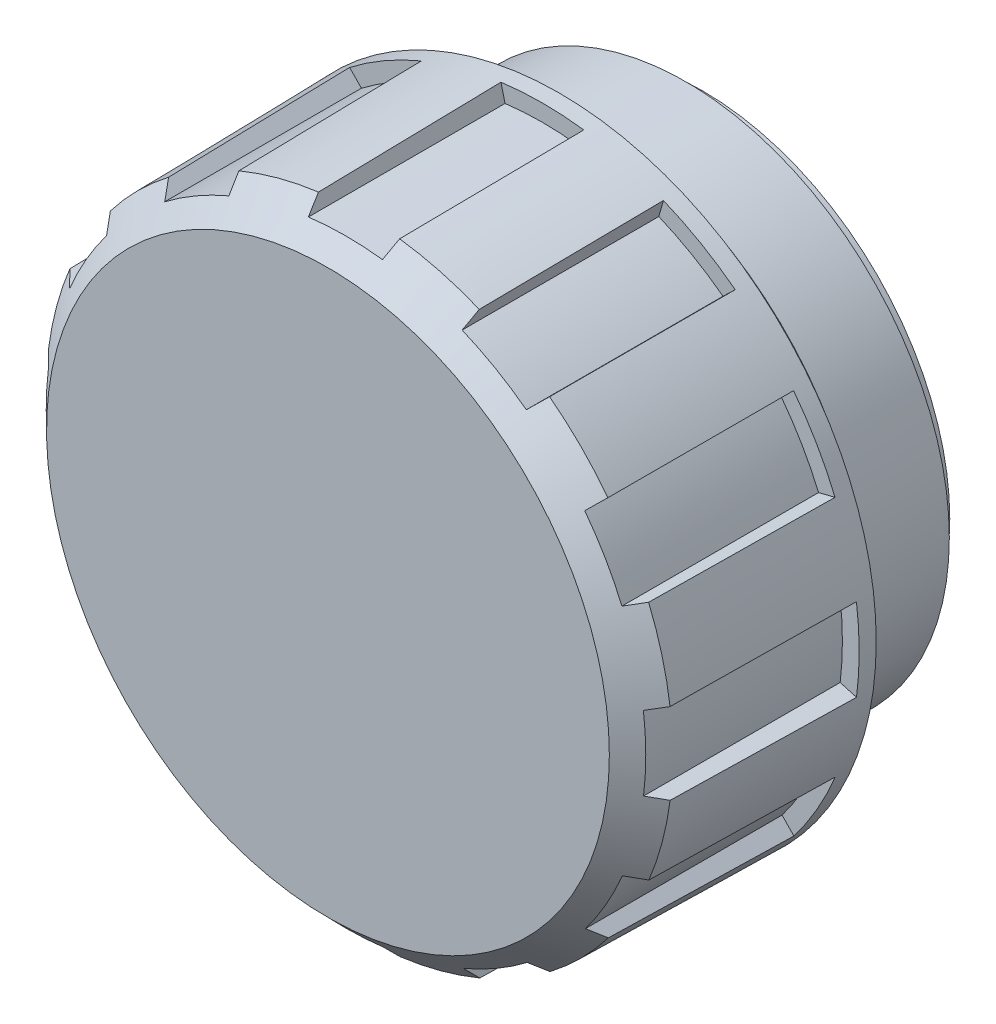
ISO-10303-21;
HEADER;
FILE_DESCRIPTION(('STEP AP214'),'2;1');
FILE_NAME('part.step','',(''),(''),'','','');
FILE_SCHEMA(('AUTOMOTIVE_DESIGN { 1 0 10303 214 1 1 1 1 }'));
ENDSEC;
DATA;
#1=APPLICATION_CONTEXT('core data for automotive mechanical design processes');
#2=APPLICATION_PROTOCOL_DEFINITION('international standard','automotive_design',2000,#1);
#3=PRODUCT_CONTEXT('',#1,'mechanical');
#4=PRODUCT('Part','Part','',(#3));
#5=PRODUCT_RELATED_PRODUCT_CATEGORY('part','',(#4));
#6=PRODUCT_DEFINITION_FORMATION('','',#4);
#7=PRODUCT_DEFINITION_CONTEXT('part definition',#1,'design');
#8=PRODUCT_DEFINITION('design','',#6,#7);
#9=PRODUCT_DEFINITION_SHAPE('','',#8);
#10=(LENGTH_UNIT() NAMED_UNIT(*) SI_UNIT(.MILLI.,.METRE.));
#11=(NAMED_UNIT(*) PLANE_ANGLE_UNIT() SI_UNIT($,.RADIAN.));
#12=(NAMED_UNIT(*) SI_UNIT($,.STERADIAN.) SOLID_ANGLE_UNIT());
#13=UNCERTAINTY_MEASURE_WITH_UNIT(LENGTH_MEASURE(1.E-05),#10,'distance_accuracy_value','');
#14=(GEOMETRIC_REPRESENTATION_CONTEXT(3) GLOBAL_UNCERTAINTY_ASSIGNED_CONTEXT((#13)) GLOBAL_UNIT_ASSIGNED_CONTEXT((#10,
#11,#12)) REPRESENTATION_CONTEXT('',''));
#15=CARTESIAN_POINT('',(0.,0.,0.));
#16=DIRECTION('',(0.,0.,1.));
#17=DIRECTION('',(1.,0.,0.));
#18=AXIS2_PLACEMENT_3D('',#15,#16,#17);
#19=CARTESIAN_POINT('',(0.,0.,2.));
#20=DIRECTION('',(0.,0.,-1.));
#21=DIRECTION('',(-1.,0.,0.));
#22=AXIS2_PLACEMENT_3D('',#19,#20,#21);
#23=CONICAL_SURFACE('',#22,28.75,0.0174532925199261);
#24=CARTESIAN_POINT('',(0.,0.,3.52));
#25=DIRECTION('',(0.,0.,1.));
#26=DIRECTION('',(1.,0.,0.));
#27=AXIS2_PLACEMENT_3D('',#24,#25,#26);
#28=CIRCLE('',#27,28.7234683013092);
#29=CARTESIAN_POINT('',(3.73437765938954,28.4796779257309,3.52));
#30=VERTEX_POINT('',#29);
#31=CARTESIAN_POINT('',(-3.78103003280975,28.473521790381,3.52));
#32=VERTEX_POINT('',#31);
#33=EDGE_CURVE('E685',#30,#32,#28,.T.);
#34=ORIENTED_EDGE('',*,*,#33,.F.);
#35=CARTESIAN_POINT('',(3.65345898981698,28.1974809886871,20.1506340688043));
#36=CARTESIAN_POINT('',(3.66694715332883,28.2445198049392,17.3788284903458));
#37=CARTESIAN_POINT('',(3.68043453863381,28.2915559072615,14.6070228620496));
#38=CARTESIAN_POINT('',(3.70740775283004,28.3856226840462,9.06341150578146));
#39=CARTESIAN_POINT('',(3.72089358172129,28.4326533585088,6.29160577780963));
#40=CARTESIAN_POINT('',(3.73437863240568,28.4796813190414,3.5198));
#41=B_SPLINE_CURVE_WITH_KNOTS('',3,(#35,#36,#37,#38,#39,#40),.UNSPECIFIED.,.F.,.F.,(4,2,4),(0.,
8.3167124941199,16.6334249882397),.UNSPECIFIED.);
#42=CARTESIAN_POINT('',(3.6534599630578,28.1974843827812,20.1504340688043));
#43=VERTEX_POINT('',#42);
#44=EDGE_CURVE('E835',#43,#30,#41,.T.);
#45=ORIENTED_EDGE('',*,*,#44,.F.);
#46=CARTESIAN_POINT('',(0.,0.,20.1504340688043));
#47=DIRECTION('',(0.,0.,1.));
#48=DIRECTION('',(1.,0.,0.));
#49=AXIS2_PLACEMENT_3D('',#46,#47,#48);
#50=CIRCLE('',#49,28.433182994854);
#51=CARTESIAN_POINT('',(10.8817666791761,26.2684801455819,20.1504340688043));
#52=VERTEX_POINT('',#51);
#53=EDGE_CURVE('E1328',#52,#43,#50,.T.);
#54=ORIENTED_EDGE('',*,*,#53,.F.);
#55=CARTESIAN_POINT('',(10.962293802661,26.5493115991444,3.5198));
#56=CARTESIAN_POINT('',(10.9488733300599,26.502508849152,6.29160573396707));
#57=CARTESIAN_POINT('',(10.9354524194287,26.4557045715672,9.06341144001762));
#58=CARTESIAN_POINT('',(10.9086097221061,26.3620929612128,14.6070227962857));
#59=CARTESIAN_POINT('',(10.8951879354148,26.3152856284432,17.3788284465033));
#60=CARTESIAN_POINT('',(10.8817657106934,26.2684767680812,20.1506340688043));
#61=B_SPLINE_CURVE_WITH_KNOTS('',3,(#55,#56,#57,#58,#59,#60),.UNSPECIFIED.,.F.,.F.,(4,2,4),(0.,
8.31669998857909,16.6333999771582),.UNSPECIFIED.);
#62=CARTESIAN_POINT('',(10.9622928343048,26.5493082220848,3.52));
#63=VERTEX_POINT('',#62);
#64=EDGE_CURVE('E829',#63,#52,#61,.T.);
#65=ORIENTED_EDGE('',*,*,#64,.F.);
#66=CARTESIAN_POINT('',(17.4739048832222,22.7969357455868,3.52));
#67=VERTEX_POINT('',#66);
#68=EDGE_CURVE('E23',#67,#63,#28,.T.);
#69=ORIENTED_EDGE('',*,*,#68,.F.);
#70=CARTESIAN_POINT('',(17.2627287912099,22.5930053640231,20.1506340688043));
#71=CARTESIAN_POINT('',(17.2979292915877,22.6269980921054,17.3788284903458));
#72=CARTESIAN_POINT('',(17.3331277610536,22.660988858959,14.6070228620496));
#73=CARTESIAN_POINT('',(17.4035206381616,22.7289664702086,9.06341150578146));
#74=CARTESIAN_POINT('',(17.4387150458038,22.7629533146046,6.29160577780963));
#75=CARTESIAN_POINT('',(17.4739074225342,22.7969381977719,3.5198));
#76=B_SPLINE_CURVE_WITH_KNOTS('',3,(#70,#71,#72,#73,#74,#75),.UNSPECIFIED.,.F.,.F.,(4,2,4),(0.,
8.3167124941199,16.6334249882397),.UNSPECIFIED.);
#77=CARTESIAN_POINT('',(17.2627313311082,22.5930078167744,20.1504340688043));
#78=VERTEX_POINT('',#77);
#79=EDGE_CURVE('E799',#78,#67,#76,.T.);
#80=ORIENTED_EDGE('',*,*,#79,.F.);
#81=CARTESIAN_POINT('',(22.5581264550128,17.3082877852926,20.1504340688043));
#82=VERTEX_POINT('',#81);
#83=EDGE_CURVE('E1334',#82,#78,#50,.T.);
#84=ORIENTED_EDGE('',*,*,#83,.F.);
#85=CARTESIAN_POINT('',(22.7682807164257,17.511231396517,3.5198));
#86=CARTESIAN_POINT('',(22.7332568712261,17.4774092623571,6.29160573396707));
#87=CARTESIAN_POINT('',(22.6982318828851,17.4435860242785,9.06341144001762));
#88=CARTESIAN_POINT('',(22.6281796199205,17.3759373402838,14.6070227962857));
#89=CARTESIAN_POINT('',(22.5931523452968,17.3421118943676,17.3788284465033));
#90=CARTESIAN_POINT('',(22.5581239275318,17.3082853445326,20.1506340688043));
#91=B_SPLINE_CURVE_WITH_KNOTS('',3,(#85,#86,#87,#88,#89,#90),.UNSPECIFIED.,.F.,.F.,(4,2,4),(0.,
8.31669998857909,16.6333999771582),.UNSPECIFIED.);
#92=CARTESIAN_POINT('',(22.7682781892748,17.5112289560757,3.52));
#93=VERTEX_POINT('',#92);
#94=EDGE_CURVE('E793',#93,#82,#91,.T.);
#95=ORIENTED_EDGE('',*,*,#94,.F.);
#96=CARTESIAN_POINT('',(26.5313134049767,11.0057730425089,3.52));
#97=VERTEX_POINT('',#96);
#98=EDGE_CURVE('E9',#97,#93,#28,.T.);
#99=ORIENTED_EDGE('',*,*,#98,.F.);
#100=CARTESIAN_POINT('',(26.2464643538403,10.9347521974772,20.1506340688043));
#101=CARTESIAN_POINT('',(26.2939452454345,10.9465905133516,17.3788284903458));
#102=CARTESIAN_POINT('',(26.3414233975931,10.958428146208,14.6070228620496));
#103=CARTESIAN_POINT('',(26.436374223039,10.9821020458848,9.06341150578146));
#104=CARTESIAN_POINT('',(26.4838468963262,10.9939383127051,6.29160577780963));
#105=CARTESIAN_POINT('',(26.5313168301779,11.0057738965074,3.5198));
#106=B_SPLINE_CURVE_WITH_KNOTS('',3,(#100,#101,#102,#103,#104,#105),.UNSPECIFIED.,.F.,.F.,(4,2,
4),(0.,8.3167124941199,16.6334249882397),.UNSPECIFIED.);
#107=CARTESIAN_POINT('',(26.2464677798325,10.934753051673,20.1504340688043));
#108=VERTEX_POINT('',#107);
#109=EDGE_CURVE('E787',#108,#97,#106,.T.);
#110=ORIENTED_EDGE('',*,*,#109,.F.);
#111=CARTESIAN_POINT('',(28.1900544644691,3.71035369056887,20.1504340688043));
#112=VERTEX_POINT('',#111);
#113=EDGE_CURVE('E1339',#112,#108,#50,.T.);
#114=ORIENTED_EDGE('',*,*,#113,.F.);
#115=CARTESIAN_POINT('',(28.4735251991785,3.78103088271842,3.5198));
#116=CARTESIAN_POINT('',(28.4262825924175,3.76925197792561,6.29160573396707));
#117=CARTESIAN_POINT('',(28.3790384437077,3.75747268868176,9.06341144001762));
#118=CARTESIAN_POINT('',(28.2845470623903,3.73391334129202,14.6070227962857));
#119=CARTESIAN_POINT('',(28.2372998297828,3.72213328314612,17.3788284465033));
#120=CARTESIAN_POINT('',(28.1900510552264,3.7103528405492,20.1506340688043));
#121=B_SPLINE_CURVE_WITH_KNOTS('',3,(#115,#116,#117,#118,#119,#120),.UNSPECIFIED.,.F.,.F.,(4,2,
4),(0.,8.31669998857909,16.6333999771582),.UNSPECIFIED.);
#122=CARTESIAN_POINT('',(28.473521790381,3.78103003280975,3.52));
#123=VERTEX_POINT('',#122);
#124=EDGE_CURVE('E741',#123,#112,#121,.T.);
#125=ORIENTED_EDGE('',*,*,#124,.F.);
#126=CARTESIAN_POINT('',(28.4796779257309,-3.73437765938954,3.52));
#127=VERTEX_POINT('',#126);
#128=EDGE_CURVE('E18',#127,#123,#28,.T.);
#129=ORIENTED_EDGE('',*,*,#128,.F.);
#130=CARTESIAN_POINT('',(28.1974809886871,-3.65345898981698,20.1506340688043));
#131=CARTESIAN_POINT('',(28.2445198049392,-3.66694715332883,17.3788284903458));
#132=CARTESIAN_POINT('',(28.2915559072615,-3.68043453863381,14.6070228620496));
#133=CARTESIAN_POINT('',(28.3856226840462,-3.70740775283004,9.06341150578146));
#134=CARTESIAN_POINT('',(28.4326533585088,-3.72089358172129,6.29160577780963));
#135=CARTESIAN_POINT('',(28.4796813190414,-3.73437863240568,3.5198));
#136=B_SPLINE_CURVE_WITH_KNOTS('',3,(#130,#131,#132,#133,#134,#135),.UNSPECIFIED.,.F.,.F.,(4,2,
4),(0.,8.3167124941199,16.6334249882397),.UNSPECIFIED.);
#137=CARTESIAN_POINT('',(28.1974843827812,-3.6534599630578,20.1504340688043));
#138=VERTEX_POINT('',#137);
#139=EDGE_CURVE('E738',#138,#127,#136,.T.);
#140=ORIENTED_EDGE('',*,*,#139,.F.);
#141=CARTESIAN_POINT('',(26.2684801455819,-10.8817666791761,20.1504340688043));
#142=VERTEX_POINT('',#141);
#143=EDGE_CURVE('E737',#142,#138,#50,.T.);
#144=ORIENTED_EDGE('',*,*,#143,.F.);
#145=CARTESIAN_POINT('',(26.5493115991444,-10.962293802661,3.5198));
#146=CARTESIAN_POINT('',(26.502508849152,-10.9488733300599,6.29160573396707));
#147=CARTESIAN_POINT('',(26.4557045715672,-10.9354524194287,9.06341144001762));
#148=CARTESIAN_POINT('',(26.3620929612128,-10.9086097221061,14.6070227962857));
#149=CARTESIAN_POINT('',(26.3152856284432,-10.8951879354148,17.3788284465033));
#150=CARTESIAN_POINT('',(26.2684767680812,-10.8817657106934,20.1506340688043));
#151=B_SPLINE_CURVE_WITH_KNOTS('',3,(#145,#146,#147,#148,#149,#150),.UNSPECIFIED.,.F.,.F.,(4,2,
4),(0.,8.31669998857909,16.6333999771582),.UNSPECIFIED.);
#152=CARTESIAN_POINT('',(26.5493082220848,-10.9622928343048,3.52));
#153=VERTEX_POINT('',#152);
#154=EDGE_CURVE('E729',#153,#142,#151,.T.);
#155=ORIENTED_EDGE('',*,*,#154,.F.);
#156=CARTESIAN_POINT('',(22.7969357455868,-17.4739048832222,3.52));
#157=VERTEX_POINT('',#156);
#158=EDGE_CURVE('E671',#157,#153,#28,.T.);
#159=ORIENTED_EDGE('',*,*,#158,.F.);
#160=CARTESIAN_POINT('',(22.5930053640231,-17.2627287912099,20.1506340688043));
#161=CARTESIAN_POINT('',(22.6269980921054,-17.2979292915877,17.3788284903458));
#162=CARTESIAN_POINT('',(22.660988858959,-17.3331277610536,14.6070228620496));
#163=CARTESIAN_POINT('',(22.7289664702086,-17.4035206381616,9.06341150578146));
#164=CARTESIAN_POINT('',(22.7629533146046,-17.4387150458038,6.29160577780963));
#165=CARTESIAN_POINT('',(22.7969381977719,-17.4739074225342,3.5198));
#166=B_SPLINE_CURVE_WITH_KNOTS('',3,(#160,#161,#162,#163,#164,#165),.UNSPECIFIED.,.F.,.F.,(4,2,
4),(0.,8.3167124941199,16.6334249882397),.UNSPECIFIED.);
#167=CARTESIAN_POINT('',(22.5930078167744,-17.2627313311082,20.1504340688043));
#168=VERTEX_POINT('',#167);
#169=EDGE_CURVE('E739',#168,#157,#166,.T.);
#170=ORIENTED_EDGE('',*,*,#169,.F.);
#171=CARTESIAN_POINT('',(17.3082877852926,-22.5581264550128,20.1504340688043));
#172=VERTEX_POINT('',#171);
#173=EDGE_CURVE('E1349',#172,#168,#50,.T.);
#174=ORIENTED_EDGE('',*,*,#173,.F.);
#175=CARTESIAN_POINT('',(17.511231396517,-22.7682807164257,3.5198));
#176=CARTESIAN_POINT('',(17.4774092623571,-22.7332568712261,6.29160573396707));
#177=CARTESIAN_POINT('',(17.4435860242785,-22.6982318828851,9.06341144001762));
#178=CARTESIAN_POINT('',(17.3759373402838,-22.6281796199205,14.6070227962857));
#179=CARTESIAN_POINT('',(17.3421118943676,-22.5931523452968,17.3788284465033));
#180=CARTESIAN_POINT('',(17.3082853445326,-22.5581239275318,20.1506340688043));
#181=B_SPLINE_CURVE_WITH_KNOTS('',3,(#175,#176,#177,#178,#179,#180),.UNSPECIFIED.,.F.,.F.,(4,2,
4),(0.,8.31669998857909,16.6333999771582),.UNSPECIFIED.);
#182=CARTESIAN_POINT('',(17.5112289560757,-22.7682781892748,3.52));
#183=VERTEX_POINT('',#182);
#184=EDGE_CURVE('E743',#183,#172,#181,.T.);
#185=ORIENTED_EDGE('',*,*,#184,.F.);
#186=CARTESIAN_POINT('',(11.0057730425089,-26.5313134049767,3.52));
#187=VERTEX_POINT('',#186);
#188=EDGE_CURVE('E704',#187,#183,#28,.T.);
#189=ORIENTED_EDGE('',*,*,#188,.F.);
#190=CARTESIAN_POINT('',(10.9347521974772,-26.2464643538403,20.1506340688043));
#191=CARTESIAN_POINT('',(10.9465905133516,-26.2939452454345,17.3788284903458));
#192=CARTESIAN_POINT('',(10.958428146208,-26.3414233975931,14.6070228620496));
#193=CARTESIAN_POINT('',(10.9821020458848,-26.436374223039,9.06341150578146));
#194=CARTESIAN_POINT('',(10.9939383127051,-26.4838468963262,6.29160577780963));
#195=CARTESIAN_POINT('',(11.0057738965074,-26.5313168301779,3.5198));
#196=B_SPLINE_CURVE_WITH_KNOTS('',3,(#190,#191,#192,#193,#194,#195),.UNSPECIFIED.,.F.,.F.,(4,2,
4),(0.,8.3167124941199,16.6334249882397),.UNSPECIFIED.);
#197=CARTESIAN_POINT('',(10.934753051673,-26.2464677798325,20.1504340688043));
#198=VERTEX_POINT('',#197);
#199=EDGE_CURVE('E1546',#198,#187,#196,.T.);
#200=ORIENTED_EDGE('',*,*,#199,.F.);
#201=CARTESIAN_POINT('',(3.71035369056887,-28.1900544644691,20.1504340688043));
#202=VERTEX_POINT('',#201);
#203=EDGE_CURVE('E1352',#202,#198,#50,.T.);
#204=ORIENTED_EDGE('',*,*,#203,.F.);
#205=CARTESIAN_POINT('',(3.78103088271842,-28.4735251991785,3.5198));
#206=CARTESIAN_POINT('',(3.76925197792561,-28.4262825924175,6.29160573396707));
#207=CARTESIAN_POINT('',(3.75747268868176,-28.3790384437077,9.06341144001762));
#208=CARTESIAN_POINT('',(3.73391334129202,-28.2845470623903,14.6070227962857));
#209=CARTESIAN_POINT('',(3.72213328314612,-28.2372998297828,17.3788284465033));
#210=CARTESIAN_POINT('',(3.7103528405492,-28.1900510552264,20.1506340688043));
#211=B_SPLINE_CURVE_WITH_KNOTS('',3,(#205,#206,#207,#208,#209,#210),.UNSPECIFIED.,.F.,.F.,(4,2,
4),(0.,8.31669998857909,16.6333999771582),.UNSPECIFIED.);
#212=CARTESIAN_POINT('',(3.78103003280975,-28.473521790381,3.52));
#213=VERTEX_POINT('',#212);
#214=EDGE_CURVE('E1540',#213,#202,#211,.T.);
#215=ORIENTED_EDGE('',*,*,#214,.F.);
#216=CARTESIAN_POINT('',(-3.73437765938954,-28.4796779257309,3.52));
#217=VERTEX_POINT('',#216);
#218=EDGE_CURVE('E698',#217,#213,#28,.T.);
#219=ORIENTED_EDGE('',*,*,#218,.F.);
#220=CARTESIAN_POINT('',(-3.65345898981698,-28.1974809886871,20.1506340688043));
#221=CARTESIAN_POINT('',(-3.66694715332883,-28.2445198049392,17.3788284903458));
#222=CARTESIAN_POINT('',(-3.68043453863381,-28.2915559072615,14.6070228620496));
#223=CARTESIAN_POINT('',(-3.70740775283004,-28.3856226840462,9.06341150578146));
#224=CARTESIAN_POINT('',(-3.72089358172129,-28.4326533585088,6.29160577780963));
#225=CARTESIAN_POINT('',(-3.73437863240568,-28.4796813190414,3.5198));
#226=B_SPLINE_CURVE_WITH_KNOTS('',3,(#220,#221,#222,#223,#224,#225),.UNSPECIFIED.,.F.,.F.,(4,2,
4),(0.,8.3167124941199,16.6334249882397),.UNSPECIFIED.);
#227=CARTESIAN_POINT('',(-3.6534599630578,-28.1974843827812,20.1504340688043));
#228=VERTEX_POINT('',#227);
#229=EDGE_CURVE('E1527',#228,#217,#226,.T.);
#230=ORIENTED_EDGE('',*,*,#229,.F.);
#231=CARTESIAN_POINT('',(-10.8817666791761,-26.2684801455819,20.1504340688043));
#232=VERTEX_POINT('',#231);
#233=EDGE_CURVE('E1357',#232,#228,#50,.T.);
#234=ORIENTED_EDGE('',*,*,#233,.F.);
#235=CARTESIAN_POINT('',(-10.962293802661,-26.5493115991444,3.5198));
#236=CARTESIAN_POINT('',(-10.9488733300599,-26.502508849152,6.29160573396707));
#237=CARTESIAN_POINT('',(-10.9354524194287,-26.4557045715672,9.06341144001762));
#238=CARTESIAN_POINT('',(-10.9086097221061,-26.3620929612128,14.6070227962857));
#239=CARTESIAN_POINT('',(-10.8951879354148,-26.3152856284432,17.3788284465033));
#240=CARTESIAN_POINT('',(-10.8817657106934,-26.2684767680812,20.1506340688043));
#241=B_SPLINE_CURVE_WITH_KNOTS('',3,(#235,#236,#237,#238,#239,#240),.UNSPECIFIED.,.F.,.F.,(4,2,
4),(0.,8.31669998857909,16.6333999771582),.UNSPECIFIED.);
#242=CARTESIAN_POINT('',(-10.9622928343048,-26.5493082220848,3.52));
#243=VERTEX_POINT('',#242);
#244=EDGE_CURVE('E1521',#243,#232,#241,.T.);
#245=ORIENTED_EDGE('',*,*,#244,.F.);
#246=CARTESIAN_POINT('',(-17.4739048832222,-22.7969357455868,3.52));
#247=VERTEX_POINT('',#246);
#248=EDGE_CURVE('E692',#247,#243,#28,.T.);
#249=ORIENTED_EDGE('',*,*,#248,.F.);
#250=CARTESIAN_POINT('',(-17.2627287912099,-22.5930053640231,20.1506340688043));
#251=CARTESIAN_POINT('',(-17.2979292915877,-22.6269980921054,17.3788284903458));
#252=CARTESIAN_POINT('',(-17.3331277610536,-22.660988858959,14.6070228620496));
#253=CARTESIAN_POINT('',(-17.4035206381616,-22.7289664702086,9.06341150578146));
#254=CARTESIAN_POINT('',(-17.4387150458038,-22.7629533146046,6.29160577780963));
#255=CARTESIAN_POINT('',(-17.4739074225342,-22.7969381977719,3.5198));
#256=B_SPLINE_CURVE_WITH_KNOTS('',3,(#250,#251,#252,#253,#254,#255),.UNSPECIFIED.,.F.,.F.,(4,2,
4),(0.,8.3167124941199,16.6334249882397),.UNSPECIFIED.);
#257=CARTESIAN_POINT('',(-17.2627313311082,-22.5930078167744,20.1504340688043));
#258=VERTEX_POINT('',#257);
#259=EDGE_CURVE('E1498',#258,#247,#256,.T.);
#260=ORIENTED_EDGE('',*,*,#259,.F.);
#261=CARTESIAN_POINT('',(-22.5581264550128,-17.3082877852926,20.1504340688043));
#262=VERTEX_POINT('',#261);
#263=EDGE_CURVE('E1362',#262,#258,#50,.T.);
#264=ORIENTED_EDGE('',*,*,#263,.F.);
#265=CARTESIAN_POINT('',(-22.7682807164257,-17.511231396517,3.5198));
#266=CARTESIAN_POINT('',(-22.7332568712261,-17.4774092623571,6.29160573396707));
#267=CARTESIAN_POINT('',(-22.6982318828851,-17.4435860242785,9.06341144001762));
#268=CARTESIAN_POINT('',(-22.6281796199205,-17.3759373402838,14.6070227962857));
#269=CARTESIAN_POINT('',(-22.5931523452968,-17.3421118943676,17.3788284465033));
#270=CARTESIAN_POINT('',(-22.5581239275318,-17.3082853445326,20.1506340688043));
#271=B_SPLINE_CURVE_WITH_KNOTS('',3,(#265,#266,#267,#268,#269,#270),.UNSPECIFIED.,.F.,.F.,(4,2,
4),(0.,8.31669998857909,16.6333999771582),.UNSPECIFIED.);
#272=CARTESIAN_POINT('',(-22.7682781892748,-17.5112289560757,3.52));
#273=VERTEX_POINT('',#272);
#274=EDGE_CURVE('E1497',#273,#262,#271,.T.);
#275=ORIENTED_EDGE('',*,*,#274,.F.);
#276=CARTESIAN_POINT('',(-26.5313134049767,-11.0057730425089,3.52));
#277=VERTEX_POINT('',#276);
#278=EDGE_CURVE('E686',#277,#273,#28,.T.);
#279=ORIENTED_EDGE('',*,*,#278,.F.);
#280=CARTESIAN_POINT('',(-26.2464643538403,-10.9347521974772,20.1506340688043));
#281=CARTESIAN_POINT('',(-26.2939452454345,-10.9465905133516,17.3788284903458));
#282=CARTESIAN_POINT('',(-26.3414233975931,-10.958428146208,14.6070228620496));
#283=CARTESIAN_POINT('',(-26.436374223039,-10.9821020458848,9.06341150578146));
#284=CARTESIAN_POINT('',(-26.4838468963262,-10.9939383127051,6.29160577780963));
#285=CARTESIAN_POINT('',(-26.5313168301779,-11.0057738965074,3.5198));
#286=B_SPLINE_CURVE_WITH_KNOTS('',3,(#280,#281,#282,#283,#284,#285),.UNSPECIFIED.,.F.,.F.,(4,2,
4),(0.,8.3167124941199,16.6334249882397),.UNSPECIFIED.);
#287=CARTESIAN_POINT('',(-26.2464677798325,-10.934753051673,20.1504340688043));
#288=VERTEX_POINT('',#287);
#289=EDGE_CURVE('E1495',#288,#277,#286,.T.);
#290=ORIENTED_EDGE('',*,*,#289,.F.);
#291=CARTESIAN_POINT('',(-28.1900544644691,-3.71035369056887,20.1504340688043));
#292=VERTEX_POINT('',#291);
#293=EDGE_CURVE('E1367',#292,#288,#50,.T.);
#294=ORIENTED_EDGE('',*,*,#293,.F.);
#295=CARTESIAN_POINT('',(-28.4735251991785,-3.78103088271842,3.5198));
#296=CARTESIAN_POINT('',(-28.4262825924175,-3.76925197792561,6.29160573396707));
#297=CARTESIAN_POINT('',(-28.3790384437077,-3.75747268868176,9.06341144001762));
#298=CARTESIAN_POINT('',(-28.2845470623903,-3.73391334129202,14.6070227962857));
#299=CARTESIAN_POINT('',(-28.2372998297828,-3.72213328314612,17.3788284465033));
#300=CARTESIAN_POINT('',(-28.1900510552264,-3.7103528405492,20.1506340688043));
#301=B_SPLINE_CURVE_WITH_KNOTS('',3,(#295,#296,#297,#298,#299,#300),.UNSPECIFIED.,.F.,.F.,(4,2,
4),(0.,8.31669998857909,16.6333999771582),.UNSPECIFIED.);
#302=CARTESIAN_POINT('',(-28.473521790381,-3.78103003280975,3.52));
#303=VERTEX_POINT('',#302);
#304=EDGE_CURVE('E409',#303,#292,#301,.T.);
#305=ORIENTED_EDGE('',*,*,#304,.F.);
#306=CARTESIAN_POINT('',(-28.4796779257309,3.73437765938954,3.52));
#307=VERTEX_POINT('',#306);
#308=EDGE_CURVE('E684',#307,#303,#28,.T.);
#309=ORIENTED_EDGE('',*,*,#308,.F.);
#310=CARTESIAN_POINT('',(-28.1974809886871,3.65345898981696,20.1506340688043));
#311=CARTESIAN_POINT('',(-28.2445198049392,3.66694715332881,17.3788284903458));
#312=CARTESIAN_POINT('',(-28.2915559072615,3.6804345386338,14.6070228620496));
#313=CARTESIAN_POINT('',(-28.3856226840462,3.70740775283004,9.06341150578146));
#314=CARTESIAN_POINT('',(-28.4326533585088,3.72089358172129,6.29160577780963));
#315=CARTESIAN_POINT('',(-28.4796813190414,3.73437863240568,3.5198));
#316=B_SPLINE_CURVE_WITH_KNOTS('',3,(#310,#311,#312,#313,#314,#315),.UNSPECIFIED.,.F.,.F.,(4,2,
4),(0.,8.3167124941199,16.6334249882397),.UNSPECIFIED.);
#317=CARTESIAN_POINT('',(-28.1974843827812,3.65345996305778,20.1504340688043));
#318=VERTEX_POINT('',#317);
#319=EDGE_CURVE('E329',#318,#307,#316,.T.);
#320=ORIENTED_EDGE('',*,*,#319,.F.);
#321=CARTESIAN_POINT('',(-26.2684801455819,10.8817666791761,20.1504340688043));
#322=VERTEX_POINT('',#321);
#323=EDGE_CURVE('E1332',#322,#318,#50,.T.);
#324=ORIENTED_EDGE('',*,*,#323,.F.);
#325=CARTESIAN_POINT('',(-26.5493115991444,10.962293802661,3.5198));
#326=CARTESIAN_POINT('',(-26.502508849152,10.9488733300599,6.29160573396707));
#327=CARTESIAN_POINT('',(-26.4557045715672,10.9354524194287,9.06341144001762));
#328=CARTESIAN_POINT('',(-26.3620929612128,10.9086097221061,14.6070227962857));
#329=CARTESIAN_POINT('',(-26.3152856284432,10.8951879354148,17.3788284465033));
#330=CARTESIAN_POINT('',(-26.2684767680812,10.8817657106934,20.1506340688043));
#331=B_SPLINE_CURVE_WITH_KNOTS('',3,(#325,#326,#327,#328,#329,#330),.UNSPECIFIED.,.F.,.F.,(4,2,
4),(0.,8.31669998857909,16.6333999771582),.UNSPECIFIED.);
#332=CARTESIAN_POINT('',(-26.5493082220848,10.9622928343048,3.52));
#333=VERTEX_POINT('',#332);
#334=EDGE_CURVE('E650',#333,#322,#331,.T.);
#335=ORIENTED_EDGE('',*,*,#334,.F.);
#336=CARTESIAN_POINT('',(-22.7969357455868,17.4739048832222,3.52));
#337=VERTEX_POINT('',#336);
#338=EDGE_CURVE('E337',#337,#333,#28,.T.);
#339=ORIENTED_EDGE('',*,*,#338,.F.);
#340=CARTESIAN_POINT('',(-22.5930053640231,17.2627287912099,20.1506340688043));
#341=CARTESIAN_POINT('',(-22.6269980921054,17.2979292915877,17.3788284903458));
#342=CARTESIAN_POINT('',(-22.660988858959,17.3331277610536,14.6070228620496));
#343=CARTESIAN_POINT('',(-22.7289664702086,17.4035206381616,9.06341150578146));
#344=CARTESIAN_POINT('',(-22.7629533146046,17.4387150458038,6.29160577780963));
#345=CARTESIAN_POINT('',(-22.7969381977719,17.4739074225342,3.5198));
#346=B_SPLINE_CURVE_WITH_KNOTS('',3,(#340,#341,#342,#343,#344,#345),.UNSPECIFIED.,.F.,.F.,(4,2,
4),(0.,8.3167124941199,16.6334249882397),.UNSPECIFIED.);
#347=CARTESIAN_POINT('',(-22.5930078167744,17.2627313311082,20.1504340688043));
#348=VERTEX_POINT('',#347);
#349=EDGE_CURVE('E643',#348,#337,#346,.T.);
#350=ORIENTED_EDGE('',*,*,#349,.F.);
#351=CARTESIAN_POINT('',(-17.3082877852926,22.5581264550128,20.1504340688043));
#352=VERTEX_POINT('',#351);
#353=EDGE_CURVE('E677',#352,#348,#50,.T.);
#354=ORIENTED_EDGE('',*,*,#353,.F.);
#355=CARTESIAN_POINT('',(-17.511231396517,22.7682807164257,3.5198));
#356=CARTESIAN_POINT('',(-17.4774092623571,22.7332568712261,6.29160573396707));
#357=CARTESIAN_POINT('',(-17.4435860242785,22.6982318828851,9.06341144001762));
#358=CARTESIAN_POINT('',(-17.3759373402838,22.6281796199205,14.6070227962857));
#359=CARTESIAN_POINT('',(-17.3421118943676,22.5931523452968,17.3788284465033));
#360=CARTESIAN_POINT('',(-17.3082853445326,22.5581239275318,20.1506340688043));
#361=B_SPLINE_CURVE_WITH_KNOTS('',3,(#355,#356,#357,#358,#359,#360),.UNSPECIFIED.,.F.,.F.,(4,2,
4),(0.,8.31669998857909,16.6333999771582),.UNSPECIFIED.);
#362=CARTESIAN_POINT('',(-17.5112289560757,22.7682781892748,3.52));
#363=VERTEX_POINT('',#362);
#364=EDGE_CURVE('E651',#363,#352,#361,.T.);
#365=ORIENTED_EDGE('',*,*,#364,.F.);
#366=CARTESIAN_POINT('',(-11.0057730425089,26.5313134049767,3.52));
#367=VERTEX_POINT('',#366);
#368=EDGE_CURVE('E683',#367,#363,#28,.T.);
#369=ORIENTED_EDGE('',*,*,#368,.F.);
#370=CARTESIAN_POINT('',(-10.9347521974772,26.2464643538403,20.1506340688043));
#371=CARTESIAN_POINT('',(-10.9465905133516,26.2939452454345,17.3788284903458));
#372=CARTESIAN_POINT('',(-10.958428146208,26.3414233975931,14.6070228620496));
#373=CARTESIAN_POINT('',(-10.9821020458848,26.436374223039,9.06341150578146));
#374=CARTESIAN_POINT('',(-10.9939383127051,26.4838468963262,6.29160577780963));
#375=CARTESIAN_POINT('',(-11.0057738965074,26.5313168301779,3.5198));
#376=B_SPLINE_CURVE_WITH_KNOTS('',3,(#370,#371,#372,#373,#374,#375),.UNSPECIFIED.,.F.,.F.,(4,2,
4),(0.,8.3167124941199,16.6334249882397),.UNSPECIFIED.);
#377=CARTESIAN_POINT('',(-10.934753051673,26.2464677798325,20.1504340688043));
#378=VERTEX_POINT('',#377);
#379=EDGE_CURVE('E847',#378,#367,#376,.T.);
#380=ORIENTED_EDGE('',*,*,#379,.F.);
#381=CARTESIAN_POINT('',(-3.71035369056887,28.1900544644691,20.1504340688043));
#382=VERTEX_POINT('',#381);
#383=EDGE_CURVE('E1323',#382,#378,#50,.T.);
#384=ORIENTED_EDGE('',*,*,#383,.F.);
#385=CARTESIAN_POINT('',(-3.78103088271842,28.4735251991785,3.5198));
#386=CARTESIAN_POINT('',(-3.76925197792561,28.4262825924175,6.29160573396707));
#387=CARTESIAN_POINT('',(-3.75747268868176,28.3790384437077,9.06341144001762));
#388=CARTESIAN_POINT('',(-3.73391334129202,28.2845470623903,14.6070227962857));
#389=CARTESIAN_POINT('',(-3.72213328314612,28.2372998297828,17.3788284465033));
#390=CARTESIAN_POINT('',(-3.7103528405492,28.1900510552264,20.1506340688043));
#391=B_SPLINE_CURVE_WITH_KNOTS('',3,(#385,#386,#387,#388,#389,#390),.UNSPECIFIED.,.F.,.F.,(4,2,
4),(0.,8.31669998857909,16.6333999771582),.UNSPECIFIED.);
#392=EDGE_CURVE('E842',#32,#382,#391,.T.);
#393=ORIENTED_EDGE('',*,*,#392,.F.);
#394=EDGE_LOOP('',(#34,#45,#54,#65,#69,#80,#84,#95,#99,#110,#114,#125,#129,#140,#144,#155,#159,
#170,#174,#185,#189,#200,#204,#215,#219,#230,#234,#245,#249,#260,#264,#275,#279,#290,#294,#305,
#309,#320,#324,#335,#339,#350,#354,#365,#369,#380,#384,#393));
#395=FACE_BOUND('',#394,.T.);
#396=CARTESIAN_POINT('',(0.,0.,2.));
#397=DIRECTION('',(0.,0.,1.));
#398=DIRECTION('',(1.,0.,0.));
#399=AXIS2_PLACEMENT_3D('',#396,#397,#398);
#400=CIRCLE('',#399,28.75);
#401=CARTESIAN_POINT('',(28.75,0.,2.));
#402=VERTEX_POINT('',#401);
#403=EDGE_CURVE('E1327',#402,#402,#400,.T.);
#404=ORIENTED_EDGE('',*,*,#403,.T.);
#405=EDGE_LOOP('',(#404));
#406=FACE_BOUND('',#405,.T.);
#407=ADVANCED_FACE('F14',(#395,#406),#23,.T.);
#408=CARTESIAN_POINT('',(0.,0.,20.1504340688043));
#409=DIRECTION('',(0.,0.,-1.));
#410=DIRECTION('',(-1.,0.,0.));
#411=AXIS2_PLACEMENT_3D('',#408,#409,#410);
#412=CONICAL_SURFACE('',#411,28.433182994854,0.794124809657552);
#413=CARTESIAN_POINT('',(0.,0.,23.));
#414=DIRECTION('',(0.,0.,1.));
#415=DIRECTION('',(1.,0.,0.));
#416=AXIS2_PLACEMENT_3D('',#413,#414,#415);
#417=CIRCLE('',#416,25.533443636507);
#418=CARTESIAN_POINT('',(25.533443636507,0.,23.));
#419=VERTEX_POINT('',#418);
#420=EDGE_CURVE('E662',#419,#419,#417,.T.);
#421=ORIENTED_EDGE('',*,*,#420,.F.);
#422=EDGE_LOOP('',(#421));
#423=FACE_BOUND('',#422,.T.);
#424=CARTESIAN_POINT('',(-26.2686770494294,10.8818231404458,20.1502340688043));
#425=CARTESIAN_POINT('',(-26.069734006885,10.8247771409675,20.3523066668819));
#426=CARTESIAN_POINT('',(-25.8707763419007,10.767726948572,20.5543636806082));
#427=CARTESIAN_POINT('',(-25.4728317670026,10.6536181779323,20.9584465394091));
#428=CARTESIAN_POINT('',(-25.2738448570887,10.5965595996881,21.1604723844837));
#429=CARTESIAN_POINT('',(-25.074843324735,10.5394968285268,21.362482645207));
#430=B_SPLINE_CURVE_WITH_KNOTS('',3,(#424,#425,#426,#427,#428,#429),.UNSPECIFIED.,.F.,.F.,(4,2,
4),(0.,0.867751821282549,1.73550364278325),.UNSPECIFIED.);
#431=CARTESIAN_POINT('',(-25.075043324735,10.539554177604,21.3622796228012));
#432=VERTEX_POINT('',#431);
#433=EDGE_CURVE('E325',#322,#432,#430,.T.);
#434=ORIENTED_EDGE('',*,*,#433,.F.);
#435=ORIENTED_EDGE('',*,*,#323,.T.);
#436=CARTESIAN_POINT('',(-26.997712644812,3.30943095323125,21.3624815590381));
#437=CARTESIAN_POINT('',(-27.1977593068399,3.36679341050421,21.1604957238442));
#438=CARTESIAN_POINT('',(-27.3977801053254,3.42414845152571,20.9584821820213));
#439=CARTESIAN_POINT('',(-27.7977699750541,3.53884370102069,20.5543996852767));
#440=CARTESIAN_POINT('',(-27.9977390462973,3.59618390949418,20.3523307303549));
#441=CARTESIAN_POINT('',(-28.1976822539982,3.65351670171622,20.1502340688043));
#442=B_SPLINE_CURVE_WITH_KNOTS('',3,(#436,#437,#438,#439,#440,#441),.UNSPECIFIED.,.F.,.F.,(4,2,
4),(0.,0.870038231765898,1.74007646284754),.UNSPECIFIED.);
#443=CARTESIAN_POINT('',(-26.997912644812,3.3094883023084,21.3622796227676));
#444=VERTEX_POINT('',#443);
#445=EDGE_CURVE('E430',#444,#318,#442,.T.);
#446=ORIENTED_EDGE('',*,*,#445,.F.);
#447=CARTESIAN_POINT('',(0.,0.,21.362279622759));
#448=DIRECTION('',(0.,0.,-1.));
#449=DIRECTION('',(-1.,0.,0.));
#450=AXIS2_PLACEMENT_3D('',#447,#448,#449);
#451=CIRCLE('',#450,27.2000000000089);
#452=CARTESIAN_POINT('',(-26.985401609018,-3.41,21.362279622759));
#453=VERTEX_POINT('',#452);
#454=EDGE_CURVE('E437',#453,#444,#451,.T.);
#455=ORIENTED_EDGE('',*,*,#454,.F.);
#456=CARTESIAN_POINT('',(-28.1902532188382,-3.71040324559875,20.1502340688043));
#457=CARTESIAN_POINT('',(-27.989440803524,-3.66033508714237,20.3523063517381));
#458=CARTESIAN_POINT('',(-27.7886136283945,-3.61026324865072,20.5543630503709));
#459=CARTESIAN_POINT('',(-27.3869297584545,-3.51011221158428,20.9584452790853));
#460=CARTESIAN_POINT('',(-27.1860730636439,-3.4600330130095,21.1604708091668));
#461=CARTESIAN_POINT('',(-26.985201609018,-3.40995013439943,21.3624807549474));
#462=B_SPLINE_CURVE_WITH_KNOTS('',3,(#456,#457,#458,#459,#460,#461),.UNSPECIFIED.,.F.,.F.,(4,2,
4),(0.,0.867750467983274,1.73550093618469),.UNSPECIFIED.);
#463=EDGE_CURVE('E451',#292,#453,#462,.T.);
#464=ORIENTED_EDGE('',*,*,#463,.F.);
#465=ORIENTED_EDGE('',*,*,#293,.T.);
#466=CARTESIAN_POINT('',(-25.035422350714,-10.6328055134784,21.3624796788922));
#467=CARTESIAN_POINT('',(-25.2373487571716,-10.6831514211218,21.160494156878));
#468=CARTESIAN_POINT('',(-25.4392490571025,-10.733490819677,20.9584809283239));
#469=CARTESIAN_POINT('',(-25.8429974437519,-10.8341565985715,20.5543990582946));
#470=CARTESIAN_POINT('',(-26.0448455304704,-10.8844829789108,20.3523304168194));
#471=CARTESIAN_POINT('',(-26.2466675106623,-10.9348028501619,20.1502340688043));
#472=B_SPLINE_CURVE_WITH_KNOTS('',3,(#466,#467,#468,#469,#470,#471),.UNSPECIFIED.,.F.,.F.,(4,2,
4),(0.,0.870036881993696,1.74007376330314),.UNSPECIFIED.);
#473=CARTESIAN_POINT('',(-25.035622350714,-10.632855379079,21.3622796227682));
#474=VERTEX_POINT('',#473);
#475=EDGE_CURVE('E458',#474,#288,#472,.T.);
#476=ORIENTED_EDGE('',*,*,#475,.F.);
#477=CARTESIAN_POINT('',(0.,0.,21.3622796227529));
#478=DIRECTION('',(0.,0.,-1.));
#479=DIRECTION('',(-1.,0.,0.));
#480=AXIS2_PLACEMENT_3D('',#477,#478,#479);
#481=CIRCLE('',#480,27.2000000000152);
#482=CARTESIAN_POINT('',(-21.665043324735,-16.445847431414,21.3622796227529));
#483=VERTEX_POINT('',#482);
#484=EDGE_CURVE('E1489',#483,#474,#481,.T.);
#485=ORIENTED_EDGE('',*,*,#484,.F.);
#486=CARTESIAN_POINT('',(-23.3373378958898,-18.0607635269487,19.0925416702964));
#487=CARTESIAN_POINT('',(-23.0776785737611,-17.8100134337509,19.4451466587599));
#488=CARTESIAN_POINT('',(-22.8179917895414,-17.5592368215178,19.7977125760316));
#489=CARTESIAN_POINT('',(-22.2605065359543,-17.0208795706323,20.5544007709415));
#490=CARTESIAN_POINT('',(-21.9626982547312,-16.7332894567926,20.9585090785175));
#491=CARTESIAN_POINT('',(-21.6648409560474,-16.445652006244,21.3625541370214));
#492=CARTESIAN_POINT('',(-21.6648385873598,-16.445649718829,21.3625573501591));
#493=CARTESIAN_POINT('',(-21.1071844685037,-15.9071293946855,22.1190182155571));
#494=CARTESIAN_POINT('',(-20.5493692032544,-15.3684534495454,22.8752429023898));
#495=CARTESIAN_POINT('',(-19.9913427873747,-14.8295736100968,23.631166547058));
#496=B_SPLINE_CURVE_WITH_KNOTS('',3,(#486,#487,#488,#489,#490,#491,#492,#493,#494,#495),
.UNSPECIFIED.,.F.,.F.,(4,2,2,2,4),(0.,1.51382287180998,3.24942427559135,3.24943807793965,
6.49887617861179),.UNSPECIFIED.);
#497=EDGE_CURVE('E467',#262,#483,#496,.T.);
#498=ORIENTED_EDGE('',*,*,#497,.F.);
#499=ORIENTED_EDGE('',*,*,#263,.T.);
#500=CARTESIAN_POINT('',(-16.3648501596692,-21.725934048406,21.3625590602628));
#501=CARTESIAN_POINT('',(-16.3648525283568,-21.725936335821,21.3625558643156));
#502=CARTESIAN_POINT('',(-16.3648548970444,-21.725938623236,21.3625526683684));
#503=CARTESIAN_POINT('',(-16.6642771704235,-22.0150873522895,20.9585577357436));
#504=CARTESIAN_POINT('',(-16.9636145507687,-22.3041540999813,20.554447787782));
#505=CARTESIAN_POINT('',(-17.5230879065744,-22.8444312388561,19.7987733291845));
#506=CARTESIAN_POINT('',(-17.7832415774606,-23.0956587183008,19.4472341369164));
#507=CARTESIAN_POINT('',(-18.0433469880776,-23.3468395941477,19.0956259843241));
#508=B_SPLINE_CURVE_WITH_KNOTS('',3,(#500,#501,#502,#503,#504,#505,#506,#507),.UNSPECIFIED.,.F.,
.F.,(4,2,2,4),(0.,1.37663808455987E-05,1.74018772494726,3.25325568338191),.UNSPECIFIED.);
#509=CARTESIAN_POINT('',(-16.365057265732,-21.726134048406,21.362279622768));
#510=VERTEX_POINT('',#509);
#511=EDGE_CURVE('E475',#510,#258,#508,.T.);
#512=ORIENTED_EDGE('',*,*,#511,.F.);
#513=CARTESIAN_POINT('',(0.,0.,21.3622796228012));
#514=DIRECTION('',(0.,0.,-1.));
#515=DIRECTION('',(-1.,0.,0.));
#516=AXIS2_PLACEMENT_3D('',#513,#514,#515);
#517=CIRCLE('',#516,27.199999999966);
#518=CARTESIAN_POINT('',(-10.539554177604,-25.075043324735,21.3622796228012));
#519=VERTEX_POINT('',#518);
#520=EDGE_CURVE('E1484',#519,#510,#517,.T.);
#521=ORIENTED_EDGE('',*,*,#520,.F.);
#522=CARTESIAN_POINT('',(-10.8818231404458,-26.2686770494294,20.1502340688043));
#523=CARTESIAN_POINT('',(-10.8247771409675,-26.069734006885,20.3523066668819));
#524=CARTESIAN_POINT('',(-10.767726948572,-25.8707763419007,20.5543636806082));
#525=CARTESIAN_POINT('',(-10.6536181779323,-25.4728317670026,20.9584465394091));
#526=CARTESIAN_POINT('',(-10.5965595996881,-25.2738448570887,21.1604723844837));
#527=CARTESIAN_POINT('',(-10.5394968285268,-25.074843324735,21.362482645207));
#528=B_SPLINE_CURVE_WITH_KNOTS('',3,(#522,#523,#524,#525,#526,#527),.UNSPECIFIED.,.F.,.F.,(4,2,
4),(0.,0.867751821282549,1.73550364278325),.UNSPECIFIED.);
#529=EDGE_CURVE('E484',#232,#519,#528,.T.);
#530=ORIENTED_EDGE('',*,*,#529,.F.);
#531=ORIENTED_EDGE('',*,*,#233,.T.);
#532=CARTESIAN_POINT('',(-3.30943095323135,-26.997712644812,21.3624815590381));
#533=CARTESIAN_POINT('',(-3.3667934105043,-27.1977593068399,21.1604957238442));
#534=CARTESIAN_POINT('',(-3.42414845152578,-27.3977801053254,20.9584821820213));
#535=CARTESIAN_POINT('',(-3.53884370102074,-27.797769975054,20.5543996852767));
#536=CARTESIAN_POINT('',(-3.59618390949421,-27.9977390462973,20.3523307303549));
#537=CARTESIAN_POINT('',(-3.65351670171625,-28.1976822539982,20.1502340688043));
#538=B_SPLINE_CURVE_WITH_KNOTS('',3,(#532,#533,#534,#535,#536,#537),.UNSPECIFIED.,.F.,.F.,(4,2,
4),(0.,0.87003823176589,1.74007646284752),.UNSPECIFIED.);
#539=CARTESIAN_POINT('',(-3.3094883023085,-26.997912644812,21.3622796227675));
#540=VERTEX_POINT('',#539);
#541=EDGE_CURVE('E492',#540,#228,#538,.T.);
#542=ORIENTED_EDGE('',*,*,#541,.F.);
#543=CARTESIAN_POINT('',(0.,0.,21.3622796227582));
#544=DIRECTION('',(0.,0.,-1.));
#545=DIRECTION('',(-1.,0.,0.));
#546=AXIS2_PLACEMENT_3D('',#543,#544,#545);
#547=CIRCLE('',#546,27.2000000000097);
#548=CARTESIAN_POINT('',(3.41,-26.985401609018,21.3622796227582));
#549=VERTEX_POINT('',#548);
#550=EDGE_CURVE('E1479',#549,#540,#547,.T.);
#551=ORIENTED_EDGE('',*,*,#550,.F.);
#552=CARTESIAN_POINT('',(3.71040324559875,-28.1902532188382,20.1502340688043));
#553=CARTESIAN_POINT('',(3.66033508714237,-27.989440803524,20.3523063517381));
#554=CARTESIAN_POINT('',(3.61026324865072,-27.7886136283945,20.5543630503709));
#555=CARTESIAN_POINT('',(3.51011221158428,-27.3869297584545,20.9584452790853));
#556=CARTESIAN_POINT('',(3.46003301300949,-27.1860730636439,21.1604708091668));
#557=CARTESIAN_POINT('',(3.40995013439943,-26.985201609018,21.3624807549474));
#558=B_SPLINE_CURVE_WITH_KNOTS('',3,(#552,#553,#554,#555,#556,#557),.UNSPECIFIED.,.F.,.F.,(4,2,
4),(0.,0.867750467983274,1.73550093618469),.UNSPECIFIED.);
#559=EDGE_CURVE('E501',#202,#549,#558,.T.);
#560=ORIENTED_EDGE('',*,*,#559,.F.);
#561=ORIENTED_EDGE('',*,*,#203,.T.);
#562=CARTESIAN_POINT('',(10.6328055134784,-25.035422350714,21.3624796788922));
#563=CARTESIAN_POINT('',(10.6831514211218,-25.2373487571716,21.160494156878));
#564=CARTESIAN_POINT('',(10.733490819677,-25.4392490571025,20.9584809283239));
#565=CARTESIAN_POINT('',(10.8341565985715,-25.8429974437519,20.5543990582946));
#566=CARTESIAN_POINT('',(10.8844829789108,-26.0448455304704,20.3523304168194));
#567=CARTESIAN_POINT('',(10.9348028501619,-26.2466675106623,20.1502340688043));
#568=B_SPLINE_CURVE_WITH_KNOTS('',3,(#562,#563,#564,#565,#566,#567),.UNSPECIFIED.,.F.,.F.,(4,2,
4),(0.,0.870036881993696,1.74007376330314),.UNSPECIFIED.);
#569=CARTESIAN_POINT('',(10.632855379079,-25.035622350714,21.3622796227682));
#570=VERTEX_POINT('',#569);
#571=EDGE_CURVE('E509',#570,#198,#568,.T.);
#572=ORIENTED_EDGE('',*,*,#571,.F.);
#573=CARTESIAN_POINT('',(0.,0.,21.3622796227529));
#574=DIRECTION('',(0.,0.,-1.));
#575=DIRECTION('',(-1.,0.,0.));
#576=AXIS2_PLACEMENT_3D('',#573,#574,#575);
#577=CIRCLE('',#576,27.2000000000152);
#578=CARTESIAN_POINT('',(16.445847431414,-21.665043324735,21.3622796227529));
#579=VERTEX_POINT('',#578);
#580=EDGE_CURVE('E1474',#579,#570,#577,.T.);
#581=ORIENTED_EDGE('',*,*,#580,.F.);
#582=CARTESIAN_POINT('',(18.0607635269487,-23.3373378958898,19.0925416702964));
#583=CARTESIAN_POINT('',(17.8100134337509,-23.0776785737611,19.4451466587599));
#584=CARTESIAN_POINT('',(17.5592368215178,-22.8179917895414,19.7977125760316));
#585=CARTESIAN_POINT('',(17.0208795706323,-22.2605065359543,20.5544007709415));
#586=CARTESIAN_POINT('',(16.7332894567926,-21.9626982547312,20.9585090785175));
#587=CARTESIAN_POINT('',(16.445652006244,-21.6648409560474,21.3625541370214));
#588=CARTESIAN_POINT('',(16.445649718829,-21.6648385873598,21.3625573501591));
#589=CARTESIAN_POINT('',(15.9071293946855,-21.1071844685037,22.1190182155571));
#590=CARTESIAN_POINT('',(15.3684534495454,-20.5493692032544,22.8752429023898));
#591=CARTESIAN_POINT('',(14.8295736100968,-19.9913427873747,23.631166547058));
#592=B_SPLINE_CURVE_WITH_KNOTS('',3,(#582,#583,#584,#585,#586,#587,#588,#589,#590,#591),
.UNSPECIFIED.,.F.,.F.,(4,2,2,2,4),(0.,1.51382287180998,3.24942427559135,3.24943807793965,
6.49887617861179),.UNSPECIFIED.);
#593=EDGE_CURVE('E518',#172,#579,#592,.T.);
#594=ORIENTED_EDGE('',*,*,#593,.F.);
#595=ORIENTED_EDGE('',*,*,#173,.T.);
#596=CARTESIAN_POINT('',(21.725934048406,-16.3648501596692,21.3625590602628));
#597=CARTESIAN_POINT('',(21.8705075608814,-16.5145604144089,21.1605603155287));
#598=CARTESIAN_POINT('',(22.0150623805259,-16.6642513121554,20.9585338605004));
#599=CARTESIAN_POINT('',(22.3041346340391,-16.9635943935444,20.5544255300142));
#600=CARTESIAN_POINT('',(22.4486520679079,-17.1132465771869,20.3523436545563));
#601=CARTESIAN_POINT('',(22.5931508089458,-17.2628794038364,20.1502340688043));
#602=B_SPLINE_CURVE_WITH_KNOTS('',3,(#596,#597,#598,#599,#600,#601),.UNSPECIFIED.,.F.,.F.,(4,2,
4),(0.,0.870093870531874,1.74018774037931),.UNSPECIFIED.);
#603=CARTESIAN_POINT('',(21.726134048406,-16.365057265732,21.362279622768));
#604=VERTEX_POINT('',#603);
#605=EDGE_CURVE('E526',#604,#168,#602,.T.);
#606=ORIENTED_EDGE('',*,*,#605,.F.);
#607=CARTESIAN_POINT('',(0.,0.,21.3622796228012));
#608=DIRECTION('',(0.,0.,-1.));
#609=DIRECTION('',(-1.,0.,0.));
#610=AXIS2_PLACEMENT_3D('',#607,#608,#609);
#611=CIRCLE('',#610,27.199999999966);
#612=CARTESIAN_POINT('',(25.075043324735,-10.539554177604,21.3622796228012));
#613=VERTEX_POINT('',#612);
#614=EDGE_CURVE('E1470',#613,#604,#611,.T.);
#615=ORIENTED_EDGE('',*,*,#614,.F.);
#616=CARTESIAN_POINT('',(26.2686770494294,-10.8818231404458,20.1502340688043));
#617=CARTESIAN_POINT('',(26.069734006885,-10.8247771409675,20.3523066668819));
#618=CARTESIAN_POINT('',(25.8707763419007,-10.767726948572,20.5543636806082));
#619=CARTESIAN_POINT('',(25.4728317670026,-10.6536181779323,20.9584465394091));
#620=CARTESIAN_POINT('',(25.2738448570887,-10.5965595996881,21.1604723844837));
#621=CARTESIAN_POINT('',(25.074843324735,-10.5394968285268,21.362482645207));
#622=B_SPLINE_CURVE_WITH_KNOTS('',3,(#616,#617,#618,#619,#620,#621),.UNSPECIFIED.,.F.,.F.,(4,2,
4),(0.,0.867751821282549,1.73550364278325),.UNSPECIFIED.);
#623=EDGE_CURVE('E535',#142,#613,#622,.T.);
#624=ORIENTED_EDGE('',*,*,#623,.F.);
#625=ORIENTED_EDGE('',*,*,#143,.T.);
#626=CARTESIAN_POINT('',(26.997712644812,-3.30943095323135,21.3624815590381));
#627=CARTESIAN_POINT('',(27.1977593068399,-3.3667934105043,21.1604957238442));
#628=CARTESIAN_POINT('',(27.3977801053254,-3.42414845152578,20.9584821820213));
#629=CARTESIAN_POINT('',(27.797769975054,-3.53884370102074,20.5543996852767));
#630=CARTESIAN_POINT('',(27.9977390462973,-3.59618390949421,20.3523307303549));
#631=CARTESIAN_POINT('',(28.1976822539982,-3.65351670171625,20.1502340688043));
#632=B_SPLINE_CURVE_WITH_KNOTS('',3,(#626,#627,#628,#629,#630,#631),.UNSPECIFIED.,.F.,.F.,(4,2,
4),(0.,0.87003823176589,1.74007646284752),.UNSPECIFIED.);
#633=CARTESIAN_POINT('',(26.997912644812,-3.3094883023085,21.3622796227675));
#634=VERTEX_POINT('',#633);
#635=EDGE_CURVE('E543',#634,#138,#632,.T.);
#636=ORIENTED_EDGE('',*,*,#635,.F.);
#637=CARTESIAN_POINT('',(0.,0.,21.3622796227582));
#638=DIRECTION('',(0.,0.,-1.));
#639=DIRECTION('',(-1.,0.,0.));
#640=AXIS2_PLACEMENT_3D('',#637,#638,#639);
#641=CIRCLE('',#640,27.2000000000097);
#642=CARTESIAN_POINT('',(26.985401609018,3.41,21.3622796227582));
#643=VERTEX_POINT('',#642);
#644=EDGE_CURVE('E1466',#643,#634,#641,.T.);
#645=ORIENTED_EDGE('',*,*,#644,.F.);
#646=CARTESIAN_POINT('',(28.1902532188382,3.71040324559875,20.1502340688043));
#647=CARTESIAN_POINT('',(27.989440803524,3.66033508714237,20.3523063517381));
#648=CARTESIAN_POINT('',(27.7886136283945,3.61026324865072,20.5543630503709));
#649=CARTESIAN_POINT('',(27.3869297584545,3.51011221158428,20.9584452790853));
#650=CARTESIAN_POINT('',(27.1860730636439,3.4600330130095,21.1604708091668));
#651=CARTESIAN_POINT('',(26.985201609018,3.40995013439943,21.3624807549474));
#652=B_SPLINE_CURVE_WITH_KNOTS('',3,(#646,#647,#648,#649,#650,#651),.UNSPECIFIED.,.F.,.F.,(4,2,
4),(0.,0.867750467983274,1.73550093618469),.UNSPECIFIED.);
#653=EDGE_CURVE('E552',#112,#643,#652,.T.);
#654=ORIENTED_EDGE('',*,*,#653,.F.);
#655=ORIENTED_EDGE('',*,*,#113,.T.);
#656=CARTESIAN_POINT('',(25.035422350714,10.6328055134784,21.3624796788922));
#657=CARTESIAN_POINT('',(25.2373487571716,10.6831514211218,21.160494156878));
#658=CARTESIAN_POINT('',(25.4392490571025,10.733490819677,20.9584809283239));
#659=CARTESIAN_POINT('',(25.8429974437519,10.8341565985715,20.5543990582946));
#660=CARTESIAN_POINT('',(26.0448455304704,10.8844829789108,20.3523304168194));
#661=CARTESIAN_POINT('',(26.2466675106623,10.9348028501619,20.1502340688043));
#662=B_SPLINE_CURVE_WITH_KNOTS('',3,(#656,#657,#658,#659,#660,#661),.UNSPECIFIED.,.F.,.F.,(4,2,
4),(0.,0.870036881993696,1.74007376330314),.UNSPECIFIED.);
#663=CARTESIAN_POINT('',(25.035622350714,10.632855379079,21.3622796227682));
#664=VERTEX_POINT('',#663);
#665=EDGE_CURVE('E560',#664,#108,#662,.T.);
#666=ORIENTED_EDGE('',*,*,#665,.F.);
#667=CARTESIAN_POINT('',(0.,0.,21.3622796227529));
#668=DIRECTION('',(0.,0.,-1.));
#669=DIRECTION('',(-1.,0.,0.));
#670=AXIS2_PLACEMENT_3D('',#667,#668,#669);
#671=CIRCLE('',#670,27.2000000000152);
#672=CARTESIAN_POINT('',(21.665043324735,16.445847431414,21.3622796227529));
#673=VERTEX_POINT('',#672);
#674=EDGE_CURVE('E1461',#673,#664,#671,.T.);
#675=ORIENTED_EDGE('',*,*,#674,.F.);
#676=CARTESIAN_POINT('',(23.3373378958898,18.0607635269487,19.0925416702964));
#677=CARTESIAN_POINT('',(23.0776785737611,17.8100134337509,19.4451466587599));
#678=CARTESIAN_POINT('',(22.8179917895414,17.5592368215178,19.7977125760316));
#679=CARTESIAN_POINT('',(22.2605065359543,17.0208795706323,20.5544007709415));
#680=CARTESIAN_POINT('',(21.9626982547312,16.7332894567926,20.9585090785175));
#681=CARTESIAN_POINT('',(21.6648409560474,16.445652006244,21.3625541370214));
#682=CARTESIAN_POINT('',(21.6648385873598,16.445649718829,21.3625573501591));
#683=CARTESIAN_POINT('',(21.1071844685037,15.9071293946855,22.1190182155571));
#684=CARTESIAN_POINT('',(20.5493692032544,15.3684534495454,22.8752429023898));
#685=CARTESIAN_POINT('',(19.9913427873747,14.8295736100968,23.631166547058));
#686=B_SPLINE_CURVE_WITH_KNOTS('',3,(#676,#677,#678,#679,#680,#681,#682,#683,#684,#685),
.UNSPECIFIED.,.F.,.F.,(4,2,2,2,4),(0.,1.51382287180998,3.24942427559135,3.24943807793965,
6.49887617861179),.UNSPECIFIED.);
#687=EDGE_CURVE('E569',#82,#673,#686,.T.);
#688=ORIENTED_EDGE('',*,*,#687,.F.);
#689=ORIENTED_EDGE('',*,*,#83,.T.);
#690=CARTESIAN_POINT('',(16.3648501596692,21.725934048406,21.3625590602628));
#691=CARTESIAN_POINT('',(16.3648525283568,21.725936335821,21.3625558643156));
#692=CARTESIAN_POINT('',(16.3648548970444,21.725938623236,21.3625526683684));
#693=CARTESIAN_POINT('',(16.6642771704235,22.0150873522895,20.9585577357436));
#694=CARTESIAN_POINT('',(16.9636145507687,22.3041540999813,20.554447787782));
#695=CARTESIAN_POINT('',(17.5230879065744,22.8444312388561,19.7987733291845));
#696=CARTESIAN_POINT('',(17.7832415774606,23.0956587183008,19.4472341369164));
#697=CARTESIAN_POINT('',(18.0433469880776,23.3468395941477,19.0956259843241));
#698=B_SPLINE_CURVE_WITH_KNOTS('',3,(#690,#691,#692,#693,#694,#695,#696,#697),.UNSPECIFIED.,.F.,
.F.,(4,2,2,4),(0.,1.37663808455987E-05,1.74018772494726,3.25325568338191),.UNSPECIFIED.);
#699=CARTESIAN_POINT('',(16.365057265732,21.726134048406,21.362279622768));
#700=VERTEX_POINT('',#699);
#701=EDGE_CURVE('E577',#700,#78,#698,.T.);
#702=ORIENTED_EDGE('',*,*,#701,.F.);
#703=CARTESIAN_POINT('',(0.,0.,21.3622796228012));
#704=DIRECTION('',(0.,0.,-1.));
#705=DIRECTION('',(-1.,0.,0.));
#706=AXIS2_PLACEMENT_3D('',#703,#704,#705);
#707=CIRCLE('',#706,27.199999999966);
#708=CARTESIAN_POINT('',(10.539554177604,25.075043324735,21.3622796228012));
#709=VERTEX_POINT('',#708);
#710=EDGE_CURVE('E1456',#709,#700,#707,.T.);
#711=ORIENTED_EDGE('',*,*,#710,.F.);
#712=CARTESIAN_POINT('',(10.8818231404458,26.2686770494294,20.1502340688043));
#713=CARTESIAN_POINT('',(10.8247771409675,26.069734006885,20.3523066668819));
#714=CARTESIAN_POINT('',(10.767726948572,25.8707763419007,20.5543636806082));
#715=CARTESIAN_POINT('',(10.6536181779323,25.4728317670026,20.9584465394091));
#716=CARTESIAN_POINT('',(10.5965595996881,25.2738448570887,21.1604723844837));
#717=CARTESIAN_POINT('',(10.5394968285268,25.074843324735,21.362482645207));
#718=B_SPLINE_CURVE_WITH_KNOTS('',3,(#712,#713,#714,#715,#716,#717),.UNSPECIFIED.,.F.,.F.,(4,2,
4),(0.,0.867751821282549,1.73550364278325),.UNSPECIFIED.);
#719=EDGE_CURVE('E586',#52,#709,#718,.T.);
#720=ORIENTED_EDGE('',*,*,#719,.F.);
#721=ORIENTED_EDGE('',*,*,#53,.T.);
#722=CARTESIAN_POINT('',(3.30943095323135,26.997712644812,21.3624815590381));
#723=CARTESIAN_POINT('',(3.3667934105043,27.1977593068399,21.1604957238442));
#724=CARTESIAN_POINT('',(3.42414845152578,27.3977801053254,20.9584821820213));
#725=CARTESIAN_POINT('',(3.53884370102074,27.797769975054,20.5543996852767));
#726=CARTESIAN_POINT('',(3.59618390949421,27.9977390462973,20.3523307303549));
#727=CARTESIAN_POINT('',(3.65351670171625,28.1976822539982,20.1502340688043));
#728=B_SPLINE_CURVE_WITH_KNOTS('',3,(#722,#723,#724,#725,#726,#727),.UNSPECIFIED.,.F.,.F.,(4,2,
4),(0.,0.87003823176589,1.74007646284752),.UNSPECIFIED.);
#729=CARTESIAN_POINT('',(3.3094883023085,26.997912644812,21.3622796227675));
#730=VERTEX_POINT('',#729);
#731=EDGE_CURVE('E594',#730,#43,#728,.T.);
#732=ORIENTED_EDGE('',*,*,#731,.F.);
#733=CARTESIAN_POINT('',(0.,0.,21.3622796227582));
#734=DIRECTION('',(0.,0.,-1.));
#735=DIRECTION('',(-1.,0.,0.));
#736=AXIS2_PLACEMENT_3D('',#733,#734,#735);
#737=CIRCLE('',#736,27.2000000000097);
#738=CARTESIAN_POINT('',(-3.41,26.985401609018,21.3622796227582));
#739=VERTEX_POINT('',#738);
#740=EDGE_CURVE('E1452',#739,#730,#737,.T.);
#741=ORIENTED_EDGE('',*,*,#740,.F.);
#742=CARTESIAN_POINT('',(-3.71040324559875,28.1902532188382,20.1502340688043));
#743=CARTESIAN_POINT('',(-3.66033508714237,27.989440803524,20.3523063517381));
#744=CARTESIAN_POINT('',(-3.61026324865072,27.7886136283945,20.5543630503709));
#745=CARTESIAN_POINT('',(-3.51011221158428,27.3869297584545,20.9584452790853));
#746=CARTESIAN_POINT('',(-3.4600330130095,27.1860730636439,21.1604708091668));
#747=CARTESIAN_POINT('',(-3.40995013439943,26.985201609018,21.3624807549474));
#748=B_SPLINE_CURVE_WITH_KNOTS('',3,(#742,#743,#744,#745,#746,#747),.UNSPECIFIED.,.F.,.F.,(4,2,
4),(0.,0.867750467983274,1.73550093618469),.UNSPECIFIED.);
#749=EDGE_CURVE('E603',#382,#739,#748,.T.);
#750=ORIENTED_EDGE('',*,*,#749,.F.);
#751=ORIENTED_EDGE('',*,*,#383,.T.);
#752=CARTESIAN_POINT('',(-10.6328055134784,25.035422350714,21.3624796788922));
#753=CARTESIAN_POINT('',(-10.6831514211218,25.2373487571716,21.160494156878));
#754=CARTESIAN_POINT('',(-10.733490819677,25.4392490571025,20.9584809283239));
#755=CARTESIAN_POINT('',(-10.8341565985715,25.8429974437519,20.5543990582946));
#756=CARTESIAN_POINT('',(-10.8844829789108,26.0448455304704,20.3523304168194));
#757=CARTESIAN_POINT('',(-10.9348028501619,26.2466675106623,20.1502340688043));
#758=B_SPLINE_CURVE_WITH_KNOTS('',3,(#752,#753,#754,#755,#756,#757),.UNSPECIFIED.,.F.,.F.,(4,2,
4),(0.,0.870036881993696,1.74007376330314),.UNSPECIFIED.);
#759=CARTESIAN_POINT('',(-10.632855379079,25.035622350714,21.3622796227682));
#760=VERTEX_POINT('',#759);
#761=EDGE_CURVE('E611',#760,#378,#758,.T.);
#762=ORIENTED_EDGE('',*,*,#761,.F.);
#763=CARTESIAN_POINT('',(0.,0.,21.3622796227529));
#764=DIRECTION('',(0.,0.,-1.));
#765=DIRECTION('',(-1.,0.,0.));
#766=AXIS2_PLACEMENT_3D('',#763,#764,#765);
#767=CIRCLE('',#766,27.2000000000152);
#768=CARTESIAN_POINT('',(-16.445847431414,21.665043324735,21.3622796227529));
#769=VERTEX_POINT('',#768);
#770=EDGE_CURVE('E1451',#769,#760,#767,.T.);
#771=ORIENTED_EDGE('',*,*,#770,.F.);
#772=CARTESIAN_POINT('',(-18.0607635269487,23.3373378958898,19.0925416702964));
#773=CARTESIAN_POINT('',(-17.8100134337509,23.0776785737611,19.4451466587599));
#774=CARTESIAN_POINT('',(-17.5592368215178,22.8179917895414,19.7977125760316));
#775=CARTESIAN_POINT('',(-17.0208795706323,22.2605065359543,20.5544007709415));
#776=CARTESIAN_POINT('',(-16.7332894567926,21.9626982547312,20.9585090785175));
#777=CARTESIAN_POINT('',(-16.445652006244,21.6648409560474,21.3625541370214));
#778=CARTESIAN_POINT('',(-16.445649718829,21.6648385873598,21.3625573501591));
#779=CARTESIAN_POINT('',(-15.9071293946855,21.1071844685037,22.1190182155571));
#780=CARTESIAN_POINT('',(-15.3684534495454,20.5493692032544,22.8752429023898));
#781=CARTESIAN_POINT('',(-14.8295736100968,19.9913427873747,23.631166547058));
#782=B_SPLINE_CURVE_WITH_KNOTS('',3,(#772,#773,#774,#775,#776,#777,#778,#779,#780,#781),
.UNSPECIFIED.,.F.,.F.,(4,2,2,2,4),(0.,1.51382287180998,3.24942427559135,3.24943807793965,
6.49887617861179),.UNSPECIFIED.);
#783=EDGE_CURVE('E619',#352,#769,#782,.T.);
#784=ORIENTED_EDGE('',*,*,#783,.F.);
#785=ORIENTED_EDGE('',*,*,#353,.T.);
#786=CARTESIAN_POINT('',(-21.725934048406,16.3648501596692,21.3625590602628));
#787=CARTESIAN_POINT('',(-21.8705075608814,16.5145604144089,21.1605603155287));
#788=CARTESIAN_POINT('',(-22.0150623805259,16.6642513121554,20.9585338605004));
#789=CARTESIAN_POINT('',(-22.3041346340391,16.9635943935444,20.5544255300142));
#790=CARTESIAN_POINT('',(-22.4486520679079,17.1132465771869,20.3523436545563));
#791=CARTESIAN_POINT('',(-22.5931508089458,17.2628794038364,20.1502340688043));
#792=B_SPLINE_CURVE_WITH_KNOTS('',3,(#786,#787,#788,#789,#790,#791),.UNSPECIFIED.,.F.,.F.,(4,2,
4),(0.,0.870093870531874,1.74018774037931),.UNSPECIFIED.);
#793=CARTESIAN_POINT('',(-21.726134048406,16.365057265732,21.362279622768));
#794=VERTEX_POINT('',#793);
#795=EDGE_CURVE('E626',#794,#348,#792,.T.);
#796=ORIENTED_EDGE('',*,*,#795,.F.);
#797=CARTESIAN_POINT('',(0.,0.,21.3622796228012));
#798=DIRECTION('',(0.,0.,-1.));
#799=DIRECTION('',(-1.,0.,0.));
#800=AXIS2_PLACEMENT_3D('',#797,#798,#799);
#801=CIRCLE('',#800,27.199999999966);
#802=EDGE_CURVE('E633',#432,#794,#801,.T.);
#803=ORIENTED_EDGE('',*,*,#802,.F.);
#804=EDGE_LOOP('',(#434,#435,#446,#455,#464,#465,#476,#485,#498,#499,#512,#521,#530,#531,#542,
#551,#560,#561,#572,#581,#594,#595,#606,#615,#624,#625,#636,#645,#654,#655,#666,#675,#688,#689,
#702,#711,#720,#721,#732,#741,#750,#751,#762,#771,#784,#785,#796,#803));
#805=FACE_BOUND('',#804,.T.);
#806=ADVANCED_FACE('F441',(#423,#805),#412,.T.);
#807=CARTESIAN_POINT('',(0.,0.,19.));
#808=DIRECTION('',(0.,0.,1.));
#809=DIRECTION('',(1.,0.,0.));
#810=AXIS2_PLACEMENT_3D('',#807,#808,#809);
#811=PLANE('',#810);
#812=CARTESIAN_POINT('',(0.,0.,19.));
#813=DIRECTION('',(0.,0.,1.));
#814=DIRECTION('',(1.,0.,0.));
#815=AXIS2_PLACEMENT_3D('',#812,#813,#814);
#816=CIRCLE('',#815,15.05918814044);
#817=CARTESIAN_POINT('',(15.05918814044,0.,19.));
#818=VERTEX_POINT('',#817);
#819=EDGE_CURVE('E438',#818,#818,#816,.T.);
#820=ORIENTED_EDGE('',*,*,#819,.F.);
#821=EDGE_LOOP('',(#820));
#822=FACE_BOUND('',#821,.T.);
#823=ADVANCED_FACE('F16',(#822),#811,.F.);
#824=CARTESIAN_POINT('',(0.,0.,17.9999999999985));
#825=DIRECTION('',(0.,0.,1.));
#826=DIRECTION('',(1.,0.,0.));
#827=AXIS2_PLACEMENT_3D('',#824,#825,#826);
#828=TOROIDAL_SURFACE('',#827,15.0591881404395,1.00000000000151);
#829=CARTESIAN_POINT('',(0.,0.,18.0348994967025));
#830=DIRECTION('',(0.,0.,1.));
#831=DIRECTION('',(1.,0.,0.));
#832=AXIS2_PLACEMENT_3D('',#829,#830,#831);
#833=CIRCLE('',#832,16.05857896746);
#834=CARTESIAN_POINT('',(16.05857896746,0.,18.0348994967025));
#835=VERTEX_POINT('',#834);
#836=EDGE_CURVE('E1606',#835,#835,#833,.T.);
#837=ORIENTED_EDGE('',*,*,#836,.F.);
#838=EDGE_LOOP('',(#837));
#839=FACE_BOUND('',#838,.T.);
#840=ORIENTED_EDGE('',*,*,#819,.T.);
#841=EDGE_LOOP('',(#840));
#842=FACE_BOUND('',#841,.T.);
#843=ADVANCED_FACE('F895',(#839,#842),#828,.F.);
#844=CARTESIAN_POINT('',(0.,0.,18.0348994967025));
#845=DIRECTION('',(0.,0.,-1.));
#846=DIRECTION('',(-1.,0.,0.));
#847=AXIS2_PLACEMENT_3D('',#844,#845,#846);
#848=CONICAL_SURFACE('',#847,16.05857896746,0.0349065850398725);
#849=CARTESIAN_POINT('',(0.,0.,-11.));
#850=DIRECTION('',(0.,0.,1.));
#851=DIRECTION('',(1.,0.,0.));
#852=AXIS2_PLACEMENT_3D('',#849,#850,#851);
#853=CIRCLE('',#852,17.0725);
#854=CARTESIAN_POINT('',(17.0725,0.,-11.));
#855=VERTEX_POINT('',#854);
#856=EDGE_CURVE('E1604',#855,#855,#853,.T.);
#857=ORIENTED_EDGE('',*,*,#856,.F.);
#858=EDGE_LOOP('',(#857));
#859=FACE_BOUND('',#858,.T.);
#860=ORIENTED_EDGE('',*,*,#836,.T.);
#861=EDGE_LOOP('',(#860));
#862=FACE_BOUND('',#861,.T.);
#863=ADVANCED_FACE('F903',(#859,#862),#848,.F.);
#864=CARTESIAN_POINT('',(0.,17.0725,-11.));
#865=DIRECTION('',(0.,0.,1.));
#866=DIRECTION('',(1.,0.,0.));
#867=AXIS2_PLACEMENT_3D('',#864,#865,#866);
#868=PLANE('',#867);
#869=CARTESIAN_POINT('',(0.,0.,-11.));
#870=DIRECTION('',(0.,0.,1.));
#871=DIRECTION('',(1.,0.,0.));
#872=AXIS2_PLACEMENT_3D('',#869,#870,#871);
#873=CIRCLE('',#872,22.4225);
#874=CARTESIAN_POINT('',(22.4225,0.,-11.));
#875=VERTEX_POINT('',#874);
#876=EDGE_CURVE('E1601',#875,#875,#873,.T.);
#877=ORIENTED_EDGE('',*,*,#876,.F.);
#878=EDGE_LOOP('',(#877));
#879=FACE_BOUND('',#878,.T.);
#880=ORIENTED_EDGE('',*,*,#856,.T.);
#881=EDGE_LOOP('',(#880));
#882=FACE_BOUND('',#881,.T.);
#883=ADVANCED_FACE('F911',(#879,#882),#868,.F.);
#884=CARTESIAN_POINT('',(0.,0.,23.));
#885=DIRECTION('',(0.,0.,1.));
#886=DIRECTION('',(1.,0.,0.));
#887=AXIS2_PLACEMENT_3D('',#884,#885,#886);
#888=CYLINDRICAL_SURFACE('',#887,22.4225);
#889=CARTESIAN_POINT('',(0.,0.,-9.48));
#890=DIRECTION('',(0.,0.,1.));
#891=DIRECTION('',(1.,0.,0.));
#892=AXIS2_PLACEMENT_3D('',#889,#890,#891);
#893=CIRCLE('',#892,22.4225);
#894=CARTESIAN_POINT('',(22.4225,0.,-9.48));
#895=VERTEX_POINT('',#894);
#896=EDGE_CURVE('E1598',#895,#895,#893,.T.);
#897=ORIENTED_EDGE('',*,*,#896,.F.);
#898=EDGE_LOOP('',(#897));
#899=FACE_BOUND('',#898,.T.);
#900=ORIENTED_EDGE('',*,*,#876,.T.);
#901=EDGE_LOOP('',(#900));
#902=FACE_BOUND('',#901,.T.);
#903=ADVANCED_FACE('F920',(#899,#902),#888,.T.);
#904=CARTESIAN_POINT('',(0.,22.4225,-9.48));
#905=DIRECTION('',(0.,0.,1.));
#906=DIRECTION('',(1.,0.,0.));
#907=AXIS2_PLACEMENT_3D('',#904,#905,#906);
#908=PLANE('',#907);
#909=CARTESIAN_POINT('',(0.,0.,-9.48));
#910=DIRECTION('',(0.,0.,1.));
#911=DIRECTION('',(1.,0.,0.));
#912=AXIS2_PLACEMENT_3D('',#909,#910,#911);
#913=CIRCLE('',#912,23.9015);
#914=CARTESIAN_POINT('',(23.9015,0.,-9.48));
#915=VERTEX_POINT('',#914);
#916=EDGE_CURVE('E1595',#915,#915,#913,.T.);
#917=ORIENTED_EDGE('',*,*,#916,.F.);
#918=EDGE_LOOP('',(#917));
#919=FACE_BOUND('',#918,.T.);
#920=ORIENTED_EDGE('',*,*,#896,.T.);
#921=EDGE_LOOP('',(#920));
#922=FACE_BOUND('',#921,.T.);
#923=ADVANCED_FACE('F929',(#919,#922),#908,.F.);
#924=CARTESIAN_POINT('',(0.,0.,23.));
#925=DIRECTION('',(0.,0.,1.));
#926=DIRECTION('',(1.,0.,0.));
#927=AXIS2_PLACEMENT_3D('',#924,#925,#926);
#928=CYLINDRICAL_SURFACE('',#927,23.9015);
#929=CARTESIAN_POINT('',(0.,0.,0.));
#930=DIRECTION('',(0.,0.,1.));
#931=DIRECTION('',(1.,0.,0.));
#932=AXIS2_PLACEMENT_3D('',#929,#930,#931);
#933=CIRCLE('',#932,23.9015);
#934=CARTESIAN_POINT('',(23.9015,0.,0.));
#935=VERTEX_POINT('',#934);
#936=EDGE_CURVE('E1592',#935,#935,#933,.T.);
#937=ORIENTED_EDGE('',*,*,#936,.F.);
#938=EDGE_LOOP('',(#937));
#939=FACE_BOUND('',#938,.T.);
#940=ORIENTED_EDGE('',*,*,#916,.T.);
#941=EDGE_LOOP('',(#940));
#942=FACE_BOUND('',#941,.T.);
#943=ADVANCED_FACE('F938',(#939,#942),#928,.T.);
#944=CARTESIAN_POINT('',(0.,23.9015,0.));
#945=DIRECTION('',(0.,0.,1.));
#946=DIRECTION('',(1.,0.,0.));
#947=AXIS2_PLACEMENT_3D('',#944,#945,#946);
#948=PLANE('',#947);
#949=CARTESIAN_POINT('',(0.,0.,0.));
#950=DIRECTION('',(0.,0.,1.));
#951=DIRECTION('',(1.,0.,0.));
#952=AXIS2_PLACEMENT_3D('',#949,#950,#951);
#953=CIRCLE('',#952,26.);
#954=CARTESIAN_POINT('',(26.,0.,0.));
#955=VERTEX_POINT('',#954);
#956=EDGE_CURVE('E1589',#955,#955,#953,.T.);
#957=ORIENTED_EDGE('',*,*,#956,.F.);
#958=EDGE_LOOP('',(#957));
#959=FACE_BOUND('',#958,.T.);
#960=ORIENTED_EDGE('',*,*,#936,.T.);
#961=EDGE_LOOP('',(#960));
#962=FACE_BOUND('',#961,.T.);
#963=ADVANCED_FACE('F947',(#959,#962),#948,.F.);
#964=CARTESIAN_POINT('',(0.,0.,23.));
#965=DIRECTION('',(0.,0.,1.));
#966=DIRECTION('',(1.,0.,0.));
#967=AXIS2_PLACEMENT_3D('',#964,#965,#966);
#968=CYLINDRICAL_SURFACE('',#967,26.);
#969=CARTESIAN_POINT('',(0.,0.,2.));
#970=DIRECTION('',(0.,0.,1.));
#971=DIRECTION('',(1.,0.,0.));
#972=AXIS2_PLACEMENT_3D('',#969,#970,#971);
#973=CIRCLE('',#972,26.);
#974=CARTESIAN_POINT('',(26.,0.,2.));
#975=VERTEX_POINT('',#974);
#976=EDGE_CURVE('E1330',#975,#975,#973,.T.);
#977=ORIENTED_EDGE('',*,*,#976,.F.);
#978=EDGE_LOOP('',(#977));
#979=FACE_BOUND('',#978,.T.);
#980=ORIENTED_EDGE('',*,*,#956,.T.);
#981=EDGE_LOOP('',(#980));
#982=FACE_BOUND('',#981,.T.);
#983=ADVANCED_FACE('F956',(#979,#982),#968,.T.);
#984=CARTESIAN_POINT('',(0.,26.,2.));
#985=DIRECTION('',(0.,0.,1.));
#986=DIRECTION('',(1.,0.,0.));
#987=AXIS2_PLACEMENT_3D('',#984,#985,#986);
#988=PLANE('',#987);
#989=ORIENTED_EDGE('',*,*,#403,.F.);
#990=EDGE_LOOP('',(#989));
#991=FACE_BOUND('',#990,.T.);
#992=ORIENTED_EDGE('',*,*,#976,.T.);
#993=EDGE_LOOP('',(#992));
#994=FACE_BOUND('',#993,.T.);
#995=ADVANCED_FACE('F965',(#991,#994),#988,.F.);
#996=CARTESIAN_POINT('',(0.,25.533443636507,23.));
#997=DIRECTION('',(0.,0.,-1.));
#998=DIRECTION('',(-1.,0.,0.));
#999=AXIS2_PLACEMENT_3D('',#996,#997,#998);
#1000=PLANE('',#999);
#1001=ORIENTED_EDGE('',*,*,#420,.T.);
#1002=EDGE_LOOP('',(#1001));
#1003=FACE_BOUND('',#1002,.T.);
#1004=ADVANCED_FACE('F425',(#1003),#1000,.F.);
#1005=CARTESIAN_POINT('',(-28.505466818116,3.7417725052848,3.52));
#1006=DIRECTION('',(-0.275637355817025,-0.961261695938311,0.));
#1007=DIRECTION('',(0.961261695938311,-0.275637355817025,0.));
#1008=AXIS2_PLACEMENT_3D('',#1005,#1006,#1007);
#1009=PLANE('',#1008);
#1010=ORIENTED_EDGE('',*,*,#319,.T.);
#1011=DIRECTION('',(0.961261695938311,-0.275637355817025,0.));
#1012=VECTOR('',#1011,1.);
#1013=CARTESIAN_POINT('',(-28.505466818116,3.7417725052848,3.52));
#1014=LINE('',#1013,#1012);
#1015=CARTESIAN_POINT('',(-26.997912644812,3.3094883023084,3.52));
#1016=VERTEX_POINT('',#1015);
#1017=EDGE_CURVE('E349',#307,#1016,#1014,.T.);
#1018=ORIENTED_EDGE('',*,*,#1017,.T.);
#1019=DIRECTION('',(0.,0.,1.));
#1020=VECTOR('',#1019,1.);
#1021=CARTESIAN_POINT('',(-26.997912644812,3.3094883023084,3.52));
#1022=LINE('',#1021,#1020);
#1023=EDGE_CURVE('E346',#1016,#444,#1022,.T.);
#1024=ORIENTED_EDGE('',*,*,#1023,.T.);
#1025=ORIENTED_EDGE('',*,*,#445,.T.);
#1026=EDGE_LOOP('',(#1010,#1018,#1024,#1025));
#1027=FACE_BOUND('',#1026,.T.);
#1028=ADVANCED_FACE('F419',(#1027),#1009,.T.);
#1029=CARTESIAN_POINT('',(8.97198981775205E-12,1.85572043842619E-12,3.52));
#1030=DIRECTION('',(0.,0.,1.));
#1031=DIRECTION('',(1.,0.,0.));
#1032=AXIS2_PLACEMENT_3D('',#1029,#1030,#1031);
#1033=CYLINDRICAL_SURFACE('',#1032,27.2000000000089);
#1034=ORIENTED_EDGE('',*,*,#454,.T.);
#1035=ORIENTED_EDGE('',*,*,#1023,.F.);
#1036=CARTESIAN_POINT('',(8.97198981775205E-12,1.85572043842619E-12,3.52));
#1037=DIRECTION('',(0.,0.,1.));
#1038=DIRECTION('',(1.,0.,0.));
#1039=AXIS2_PLACEMENT_3D('',#1036,#1037,#1038);
#1040=CIRCLE('',#1039,27.2000000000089);
#1041=CARTESIAN_POINT('',(-26.985401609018,-3.41,3.52));
#1042=VERTEX_POINT('',#1041);
#1043=EDGE_CURVE('E1383',#1016,#1042,#1040,.T.);
#1044=ORIENTED_EDGE('',*,*,#1043,.T.);
#1045=DIRECTION('',(0.,0.,1.));
#1046=VECTOR('',#1045,1.);
#1047=CARTESIAN_POINT('',(-26.985401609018,-3.41,3.52));
#1048=LINE('',#1047,#1046);
#1049=EDGE_CURVE('E348',#1042,#453,#1048,.T.);
#1050=ORIENTED_EDGE('',*,*,#1049,.T.);
#1051=EDGE_LOOP('',(#1034,#1035,#1044,#1050));
#1052=FACE_BOUND('',#1051,.T.);
#1053=ADVANCED_FACE('F424',(#1052),#1033,.T.);
#1054=CARTESIAN_POINT('',(-26.985401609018,-3.41,3.52));
#1055=DIRECTION('',(-0.241921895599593,0.970295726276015,0.));
#1056=DIRECTION('',(-0.970295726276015,-0.241921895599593,0.));
#1057=AXIS2_PLACEMENT_3D('',#1054,#1055,#1056);
#1058=PLANE('',#1057);
#1059=ORIENTED_EDGE('',*,*,#304,.T.);
#1060=ORIENTED_EDGE('',*,*,#463,.T.);
#1061=ORIENTED_EDGE('',*,*,#1049,.F.);
#1062=DIRECTION('',(-0.970295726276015,-0.241921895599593,0.));
#1063=VECTOR('',#1062,1.);
#1064=CARTESIAN_POINT('',(-26.985401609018,-3.41,3.52));
#1065=LINE('',#1064,#1063);
#1066=EDGE_CURVE('E1385',#1042,#303,#1065,.T.);
#1067=ORIENTED_EDGE('',*,*,#1066,.T.);
#1068=EDGE_LOOP('',(#1059,#1060,#1061,#1067));
#1069=FACE_BOUND('',#1068,.T.);
#1070=ADVANCED_FACE('F992',(#1069),#1058,.T.);
#1071=CARTESIAN_POINT('',(0.,0.,3.52));
#1072=DIRECTION('',(0.,0.,1.));
#1073=DIRECTION('',(1.,0.,0.));
#1074=AXIS2_PLACEMENT_3D('',#1071,#1072,#1073);
#1075=PLANE('',#1074);
#1076=ORIENTED_EDGE('',*,*,#308,.T.);
#1077=ORIENTED_EDGE('',*,*,#1066,.F.);
#1078=ORIENTED_EDGE('',*,*,#1043,.F.);
#1079=ORIENTED_EDGE('',*,*,#1017,.F.);
#1080=EDGE_LOOP('',(#1076,#1077,#1078,#1079));
#1081=FACE_BOUND('',#1080,.T.);
#1082=ADVANCED_FACE('F1000',(#1081),#1075,.T.);
#1083=CARTESIAN_POINT('',(-26.557344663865,-11.012263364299,3.52));
#1084=DIRECTION('',(0.241921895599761,-0.970295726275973,0.));
#1085=DIRECTION('',(0.970295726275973,0.241921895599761,0.));
#1086=AXIS2_PLACEMENT_3D('',#1083,#1084,#1085);
#1087=PLANE('',#1086);
#1088=ORIENTED_EDGE('',*,*,#289,.T.);
#1089=DIRECTION('',(0.970295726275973,0.241921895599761,0.));
#1090=VECTOR('',#1089,1.);
#1091=CARTESIAN_POINT('',(-26.557344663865,-11.012263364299,3.52));
#1092=LINE('',#1091,#1090);
#1093=CARTESIAN_POINT('',(-25.035622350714,-10.632855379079,3.52));
#1094=VERTEX_POINT('',#1093);
#1095=EDGE_CURVE('E1389',#277,#1094,#1092,.T.);
#1096=ORIENTED_EDGE('',*,*,#1095,.T.);
#1097=DIRECTION('',(0.,0.,1.));
#1098=VECTOR('',#1097,1.);
#1099=CARTESIAN_POINT('',(-25.035622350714,-10.632855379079,3.52));
#1100=LINE('',#1099,#1098);
#1101=EDGE_CURVE('E352',#1094,#474,#1100,.T.);
#1102=ORIENTED_EDGE('',*,*,#1101,.T.);
#1103=ORIENTED_EDGE('',*,*,#475,.T.);
#1104=EDGE_LOOP('',(#1088,#1096,#1102,#1103));
#1105=FACE_BOUND('',#1104,.T.);
#1106=ADVANCED_FACE('F1008',(#1105),#1087,.T.);
#1107=CARTESIAN_POINT('',(1.38847267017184E-11,7.08461067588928E-12,3.52));
#1108=DIRECTION('',(0.,0.,1.));
#1109=DIRECTION('',(1.,0.,0.));
#1110=AXIS2_PLACEMENT_3D('',#1107,#1108,#1109);
#1111=CYLINDRICAL_SURFACE('',#1110,27.2000000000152);
#1112=ORIENTED_EDGE('',*,*,#484,.T.);
#1113=ORIENTED_EDGE('',*,*,#1101,.F.);
#1114=CARTESIAN_POINT('',(1.38847267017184E-11,7.08461067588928E-12,3.52));
#1115=DIRECTION('',(0.,0.,1.));
#1116=DIRECTION('',(1.,0.,0.));
#1117=AXIS2_PLACEMENT_3D('',#1114,#1115,#1116);
#1118=CIRCLE('',#1117,27.2000000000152);
#1119=CARTESIAN_POINT('',(-21.665043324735,-16.445847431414,3.52));
#1120=VERTEX_POINT('',#1119);
#1121=EDGE_CURVE('E1391',#1094,#1120,#1118,.T.);
#1122=ORIENTED_EDGE('',*,*,#1121,.T.);
#1123=DIRECTION('',(0.,0.,1.));
#1124=VECTOR('',#1123,1.);
#1125=CARTESIAN_POINT('',(-21.665043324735,-16.445847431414,3.52));
#1126=LINE('',#1125,#1124);
#1127=EDGE_CURVE('E354',#1120,#483,#1126,.T.);
#1128=ORIENTED_EDGE('',*,*,#1127,.T.);
#1129=EDGE_LOOP('',(#1112,#1113,#1122,#1128));
#1130=FACE_BOUND('',#1129,.T.);
#1131=ADVANCED_FACE('F1016',(#1130),#1111,.T.);
#1132=CARTESIAN_POINT('',(-21.665043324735,-16.445847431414,3.52));
#1133=DIRECTION('',(-0.694658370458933,0.719339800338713,0.));
#1134=DIRECTION('',(-0.719339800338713,-0.694658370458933,0.));
#1135=AXIS2_PLACEMENT_3D('',#1132,#1133,#1134);
#1136=PLANE('',#1135);
#1137=ORIENTED_EDGE('',*,*,#274,.T.);
#1138=ORIENTED_EDGE('',*,*,#497,.T.);
#1139=ORIENTED_EDGE('',*,*,#1127,.F.);
#1140=DIRECTION('',(-0.719339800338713,-0.694658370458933,0.));
#1141=VECTOR('',#1140,1.);
#1142=CARTESIAN_POINT('',(-21.665043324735,-16.445847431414,3.52));
#1143=LINE('',#1142,#1141);
#1144=EDGE_CURVE('E1394',#1120,#273,#1143,.T.);
#1145=ORIENTED_EDGE('',*,*,#1144,.T.);
#1146=EDGE_LOOP('',(#1137,#1138,#1139,#1145));
#1147=FACE_BOUND('',#1146,.T.);
#1148=ADVANCED_FACE('F1024',(#1147),#1136,.T.);
#1149=ORIENTED_EDGE('',*,*,#278,.T.);
#1150=ORIENTED_EDGE('',*,*,#1144,.F.);
#1151=ORIENTED_EDGE('',*,*,#1121,.F.);
#1152=ORIENTED_EDGE('',*,*,#1095,.F.);
#1153=EDGE_LOOP('',(#1149,#1150,#1151,#1152));
#1154=FACE_BOUND('',#1153,.T.);
#1155=ADVANCED_FACE('F1009',(#1154),#1075,.T.);
#1156=CARTESIAN_POINT('',(-17.493203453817,-22.81557215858,3.52));
#1157=DIRECTION('',(0.694658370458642,-0.719339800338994,0.));
#1158=DIRECTION('',(0.719339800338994,0.694658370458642,0.));
#1159=AXIS2_PLACEMENT_3D('',#1156,#1157,#1158);
#1160=PLANE('',#1159);
#1161=ORIENTED_EDGE('',*,*,#259,.T.);
#1162=DIRECTION('',(0.719339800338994,0.694658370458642,0.));
#1163=VECTOR('',#1162,1.);
#1164=CARTESIAN_POINT('',(-17.493203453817,-22.81557215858,3.52));
#1165=LINE('',#1164,#1163);
#1166=CARTESIAN_POINT('',(-16.365057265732,-21.726134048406,3.52));
#1167=VERTEX_POINT('',#1166);
#1168=EDGE_CURVE('E1396',#247,#1167,#1165,.T.);
#1169=ORIENTED_EDGE('',*,*,#1168,.T.);
#1170=DIRECTION('',(0.,0.,1.));
#1171=VECTOR('',#1170,1.);
#1172=CARTESIAN_POINT('',(-16.365057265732,-21.726134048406,3.52));
#1173=LINE('',#1172,#1171);
#1174=EDGE_CURVE('E357',#1167,#510,#1173,.T.);
#1175=ORIENTED_EDGE('',*,*,#1174,.T.);
#1176=ORIENTED_EDGE('',*,*,#511,.T.);
#1177=EDGE_LOOP('',(#1161,#1169,#1175,#1176));
#1178=FACE_BOUND('',#1177,.T.);
#1179=ADVANCED_FACE('F1040',(#1178),#1160,.T.);
#1180=CARTESIAN_POINT('',(-1.74010111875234E-11,-2.92647850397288E-11,3.52));
#1181=DIRECTION('',(0.,0.,1.));
#1182=DIRECTION('',(1.,0.,0.));
#1183=AXIS2_PLACEMENT_3D('',#1180,#1181,#1182);
#1184=CYLINDRICAL_SURFACE('',#1183,27.199999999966);
#1185=ORIENTED_EDGE('',*,*,#520,.T.);
#1186=ORIENTED_EDGE('',*,*,#1174,.F.);
#1187=CARTESIAN_POINT('',(-1.74010111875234E-11,-2.92647850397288E-11,3.52));
#1188=DIRECTION('',(0.,0.,1.));
#1189=DIRECTION('',(1.,0.,0.));
#1190=AXIS2_PLACEMENT_3D('',#1187,#1188,#1189);
#1191=CIRCLE('',#1190,27.199999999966);
#1192=CARTESIAN_POINT('',(-10.539554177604,-25.075043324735,3.52));
#1193=VERTEX_POINT('',#1192);
#1194=EDGE_CURVE('E1398',#1167,#1193,#1191,.T.);
#1195=ORIENTED_EDGE('',*,*,#1194,.T.);
#1196=DIRECTION('',(0.,0.,1.));
#1197=VECTOR('',#1196,1.);
#1198=CARTESIAN_POINT('',(-10.539554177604,-25.075043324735,3.52));
#1199=LINE('',#1198,#1197);
#1200=EDGE_CURVE('E359',#1193,#519,#1199,.T.);
#1201=ORIENTED_EDGE('',*,*,#1200,.T.);
#1202=EDGE_LOOP('',(#1185,#1186,#1195,#1201));
#1203=FACE_BOUND('',#1202,.T.);
#1204=ADVANCED_FACE('F1048',(#1203),#1184,.T.);
#1205=CARTESIAN_POINT('',(-10.539554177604,-25.075043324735,3.52));
#1206=DIRECTION('',(-0.961261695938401,0.275637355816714,0.));
#1207=DIRECTION('',(-0.275637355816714,-0.961261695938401,0.));
#1208=AXIS2_PLACEMENT_3D('',#1205,#1206,#1207);
#1209=PLANE('',#1208);
#1210=ORIENTED_EDGE('',*,*,#244,.T.);
#1211=ORIENTED_EDGE('',*,*,#529,.T.);
#1212=ORIENTED_EDGE('',*,*,#1200,.F.);
#1213=DIRECTION('',(-0.275637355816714,-0.9612616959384,0.));
#1214=VECTOR('',#1213,1.);
#1215=CARTESIAN_POINT('',(-10.539554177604,-25.075043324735,3.52));
#1216=LINE('',#1215,#1214);
#1217=EDGE_CURVE('E1401',#1193,#243,#1216,.T.);
#1218=ORIENTED_EDGE('',*,*,#1217,.T.);
#1219=EDGE_LOOP('',(#1210,#1211,#1212,#1218));
#1220=FACE_BOUND('',#1219,.T.);
#1221=ADVANCED_FACE('F1056',(#1220),#1209,.T.);
#1222=ORIENTED_EDGE('',*,*,#248,.T.);
#1223=ORIENTED_EDGE('',*,*,#1217,.F.);
#1224=ORIENTED_EDGE('',*,*,#1194,.F.);
#1225=ORIENTED_EDGE('',*,*,#1168,.F.);
#1226=EDGE_LOOP('',(#1222,#1223,#1224,#1225));
#1227=FACE_BOUND('',#1226,.T.);
#1228=ADVANCED_FACE('F1041',(#1227),#1075,.T.);
#1229=CARTESIAN_POINT('',(-3.7417725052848,-28.505466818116,3.52));
#1230=DIRECTION('',(0.961261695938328,-0.275637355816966,0.));
#1231=DIRECTION('',(0.275637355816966,0.961261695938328,0.));
#1232=AXIS2_PLACEMENT_3D('',#1229,#1230,#1231);
#1233=PLANE('',#1232);
#1234=ORIENTED_EDGE('',*,*,#229,.T.);
#1235=DIRECTION('',(0.275637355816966,0.961261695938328,0.));
#1236=VECTOR('',#1235,1.);
#1237=CARTESIAN_POINT('',(-3.7417725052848,-28.505466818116,3.52));
#1238=LINE('',#1237,#1236);
#1239=CARTESIAN_POINT('',(-3.3094883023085,-26.997912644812,3.52));
#1240=VERTEX_POINT('',#1239);
#1241=EDGE_CURVE('E1403',#217,#1240,#1238,.T.);
#1242=ORIENTED_EDGE('',*,*,#1241,.T.);
#1243=DIRECTION('',(0.,0.,1.));
#1244=VECTOR('',#1243,1.);
#1245=CARTESIAN_POINT('',(-3.3094883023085,-26.997912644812,3.52));
#1246=LINE('',#1245,#1244);
#1247=EDGE_CURVE('E362',#1240,#540,#1246,.T.);
#1248=ORIENTED_EDGE('',*,*,#1247,.T.);
#1249=ORIENTED_EDGE('',*,*,#541,.T.);
#1250=EDGE_LOOP('',(#1234,#1242,#1248,#1249));
#1251=FACE_BOUND('',#1250,.T.);
#1252=ADVANCED_FACE('F1072',(#1251),#1233,.T.);
#1253=CARTESIAN_POINT('',(-1.90667794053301E-12,9.75955427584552E-12,3.52));
#1254=DIRECTION('',(0.,0.,1.));
#1255=DIRECTION('',(1.,0.,0.));
#1256=AXIS2_PLACEMENT_3D('',#1253,#1254,#1255);
#1257=CYLINDRICAL_SURFACE('',#1256,27.2000000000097);
#1258=ORIENTED_EDGE('',*,*,#550,.T.);
#1259=ORIENTED_EDGE('',*,*,#1247,.F.);
#1260=CARTESIAN_POINT('',(-1.90667794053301E-12,9.75955427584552E-12,3.52));
#1261=DIRECTION('',(0.,0.,1.));
#1262=DIRECTION('',(1.,0.,0.));
#1263=AXIS2_PLACEMENT_3D('',#1260,#1261,#1262);
#1264=CIRCLE('',#1263,27.2000000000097);
#1265=CARTESIAN_POINT('',(3.41,-26.985401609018,3.52));
#1266=VERTEX_POINT('',#1265);
#1267=EDGE_CURVE('E1405',#1240,#1266,#1264,.T.);
#1268=ORIENTED_EDGE('',*,*,#1267,.T.);
#1269=DIRECTION('',(0.,0.,1.));
#1270=VECTOR('',#1269,1.);
#1271=CARTESIAN_POINT('',(3.41,-26.985401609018,3.52));
#1272=LINE('',#1271,#1270);
#1273=EDGE_CURVE('E364',#1266,#549,#1272,.T.);
#1274=ORIENTED_EDGE('',*,*,#1273,.T.);
#1275=EDGE_LOOP('',(#1258,#1259,#1268,#1274));
#1276=FACE_BOUND('',#1275,.T.);
#1277=ADVANCED_FACE('F1080',(#1276),#1257,.T.);
#1278=CARTESIAN_POINT('',(3.41,-26.985401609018,3.52));
#1279=DIRECTION('',(-0.970295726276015,-0.241921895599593,0.));
#1280=DIRECTION('',(0.241921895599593,-0.970295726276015,0.));
#1281=AXIS2_PLACEMENT_3D('',#1278,#1279,#1280);
#1282=PLANE('',#1281);
#1283=ORIENTED_EDGE('',*,*,#214,.T.);
#1284=ORIENTED_EDGE('',*,*,#559,.T.);
#1285=ORIENTED_EDGE('',*,*,#1273,.F.);
#1286=DIRECTION('',(0.241921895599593,-0.970295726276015,0.));
#1287=VECTOR('',#1286,1.);
#1288=CARTESIAN_POINT('',(3.41,-26.985401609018,3.52));
#1289=LINE('',#1288,#1287);
#1290=EDGE_CURVE('E1408',#1266,#213,#1289,.T.);
#1291=ORIENTED_EDGE('',*,*,#1290,.T.);
#1292=EDGE_LOOP('',(#1283,#1284,#1285,#1291));
#1293=FACE_BOUND('',#1292,.T.);
#1294=ADVANCED_FACE('F1088',(#1293),#1282,.T.);
#1295=ORIENTED_EDGE('',*,*,#218,.T.);
#1296=ORIENTED_EDGE('',*,*,#1290,.F.);
#1297=ORIENTED_EDGE('',*,*,#1267,.F.);
#1298=ORIENTED_EDGE('',*,*,#1241,.F.);
#1299=EDGE_LOOP('',(#1295,#1296,#1297,#1298));
#1300=FACE_BOUND('',#1299,.T.);
#1301=ADVANCED_FACE('F1073',(#1300),#1075,.T.);
#1302=CARTESIAN_POINT('',(11.012263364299,-26.557344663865,3.52));
#1303=DIRECTION('',(0.970295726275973,0.241921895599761,0.));
#1304=DIRECTION('',(-0.241921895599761,0.970295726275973,0.));
#1305=AXIS2_PLACEMENT_3D('',#1302,#1303,#1304);
#1306=PLANE('',#1305);
#1307=ORIENTED_EDGE('',*,*,#199,.T.);
#1308=DIRECTION('',(-0.241921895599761,0.970295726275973,0.));
#1309=VECTOR('',#1308,1.);
#1310=CARTESIAN_POINT('',(11.012263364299,-26.557344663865,3.52));
#1311=LINE('',#1310,#1309);
#1312=CARTESIAN_POINT('',(10.632855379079,-25.035622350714,3.52));
#1313=VERTEX_POINT('',#1312);
#1314=EDGE_CURVE('E1410',#187,#1313,#1311,.T.);
#1315=ORIENTED_EDGE('',*,*,#1314,.T.);
#1316=DIRECTION('',(0.,0.,1.));
#1317=VECTOR('',#1316,1.);
#1318=CARTESIAN_POINT('',(10.632855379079,-25.035622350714,3.52));
#1319=LINE('',#1318,#1317);
#1320=EDGE_CURVE('E367',#1313,#570,#1319,.T.);
#1321=ORIENTED_EDGE('',*,*,#1320,.T.);
#1322=ORIENTED_EDGE('',*,*,#571,.T.);
#1323=EDGE_LOOP('',(#1307,#1315,#1321,#1322));
#1324=FACE_BOUND('',#1323,.T.);
#1325=ADVANCED_FACE('F1104',(#1324),#1306,.T.);
#1326=CARTESIAN_POINT('',(-7.08461067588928E-12,1.38847267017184E-11,3.52));
#1327=DIRECTION('',(0.,0.,1.));
#1328=DIRECTION('',(1.,0.,0.));
#1329=AXIS2_PLACEMENT_3D('',#1326,#1327,#1328);
#1330=CYLINDRICAL_SURFACE('',#1329,27.2000000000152);
#1331=ORIENTED_EDGE('',*,*,#580,.T.);
#1332=ORIENTED_EDGE('',*,*,#1320,.F.);
#1333=CARTESIAN_POINT('',(-7.08461067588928E-12,1.38847267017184E-11,3.52));
#1334=DIRECTION('',(0.,0.,1.));
#1335=DIRECTION('',(1.,0.,0.));
#1336=AXIS2_PLACEMENT_3D('',#1333,#1334,#1335);
#1337=CIRCLE('',#1336,27.2000000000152);
#1338=CARTESIAN_POINT('',(16.445847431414,-21.665043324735,3.52));
#1339=VERTEX_POINT('',#1338);
#1340=EDGE_CURVE('E1412',#1313,#1339,#1337,.T.);
#1341=ORIENTED_EDGE('',*,*,#1340,.T.);
#1342=DIRECTION('',(0.,0.,1.));
#1343=VECTOR('',#1342,1.);
#1344=CARTESIAN_POINT('',(16.445847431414,-21.665043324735,3.52));
#1345=LINE('',#1344,#1343);
#1346=EDGE_CURVE('E369',#1339,#579,#1345,.T.);
#1347=ORIENTED_EDGE('',*,*,#1346,.T.);
#1348=EDGE_LOOP('',(#1331,#1332,#1341,#1347));
#1349=FACE_BOUND('',#1348,.T.);
#1350=ADVANCED_FACE('F1112',(#1349),#1330,.T.);
#1351=CARTESIAN_POINT('',(16.445847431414,-21.665043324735,3.52));
#1352=DIRECTION('',(-0.719339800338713,-0.694658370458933,0.));
#1353=DIRECTION('',(0.694658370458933,-0.719339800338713,0.));
#1354=AXIS2_PLACEMENT_3D('',#1351,#1352,#1353);
#1355=PLANE('',#1354);
#1356=ORIENTED_EDGE('',*,*,#184,.T.);
#1357=ORIENTED_EDGE('',*,*,#593,.T.);
#1358=ORIENTED_EDGE('',*,*,#1346,.F.);
#1359=DIRECTION('',(0.694658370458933,-0.719339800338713,0.));
#1360=VECTOR('',#1359,1.);
#1361=CARTESIAN_POINT('',(16.445847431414,-21.665043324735,3.52));
#1362=LINE('',#1361,#1360);
#1363=EDGE_CURVE('E1415',#1339,#183,#1362,.T.);
#1364=ORIENTED_EDGE('',*,*,#1363,.T.);
#1365=EDGE_LOOP('',(#1356,#1357,#1358,#1364));
#1366=FACE_BOUND('',#1365,.T.);
#1367=ADVANCED_FACE('F1120',(#1366),#1355,.T.);
#1368=ORIENTED_EDGE('',*,*,#188,.T.);
#1369=ORIENTED_EDGE('',*,*,#1363,.F.);
#1370=ORIENTED_EDGE('',*,*,#1340,.F.);
#1371=ORIENTED_EDGE('',*,*,#1314,.F.);
#1372=EDGE_LOOP('',(#1368,#1369,#1370,#1371));
#1373=FACE_BOUND('',#1372,.T.);
#1374=ADVANCED_FACE('F1105',(#1373),#1075,.T.);
#1375=CARTESIAN_POINT('',(22.81557215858,-17.493203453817,3.52));
#1376=DIRECTION('',(0.719339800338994,0.694658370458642,0.));
#1377=DIRECTION('',(-0.694658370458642,0.719339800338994,0.));
#1378=AXIS2_PLACEMENT_3D('',#1375,#1376,#1377);
#1379=PLANE('',#1378);
#1380=ORIENTED_EDGE('',*,*,#169,.T.);
#1381=DIRECTION('',(-0.694658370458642,0.719339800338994,0.));
#1382=VECTOR('',#1381,1.);
#1383=CARTESIAN_POINT('',(22.81557215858,-17.493203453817,3.52));
#1384=LINE('',#1383,#1382);
#1385=CARTESIAN_POINT('',(21.726134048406,-16.365057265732,3.52));
#1386=VERTEX_POINT('',#1385);
#1387=EDGE_CURVE('E724',#157,#1386,#1384,.T.);
#1388=ORIENTED_EDGE('',*,*,#1387,.T.);
#1389=DIRECTION('',(0.,0.,1.));
#1390=VECTOR('',#1389,1.);
#1391=CARTESIAN_POINT('',(21.726134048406,-16.365057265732,3.52));
#1392=LINE('',#1391,#1390);
#1393=EDGE_CURVE('E372',#1386,#604,#1392,.T.);
#1394=ORIENTED_EDGE('',*,*,#1393,.T.);
#1395=ORIENTED_EDGE('',*,*,#605,.T.);
#1396=EDGE_LOOP('',(#1380,#1388,#1394,#1395));
#1397=FACE_BOUND('',#1396,.T.);
#1398=ADVANCED_FACE('F1136',(#1397),#1379,.T.);
#1399=CARTESIAN_POINT('',(2.92647850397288E-11,-1.74010111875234E-11,3.52));
#1400=DIRECTION('',(0.,0.,1.));
#1401=DIRECTION('',(1.,0.,0.));
#1402=AXIS2_PLACEMENT_3D('',#1399,#1400,#1401);
#1403=CYLINDRICAL_SURFACE('',#1402,27.199999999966);
#1404=ORIENTED_EDGE('',*,*,#614,.T.);
#1405=ORIENTED_EDGE('',*,*,#1393,.F.);
#1406=CARTESIAN_POINT('',(2.92647850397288E-11,-1.74010111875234E-11,3.52));
#1407=DIRECTION('',(0.,0.,1.));
#1408=DIRECTION('',(1.,0.,0.));
#1409=AXIS2_PLACEMENT_3D('',#1406,#1407,#1408);
#1410=CIRCLE('',#1409,27.199999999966);
#1411=CARTESIAN_POINT('',(25.075043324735,-10.539554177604,3.52));
#1412=VERTEX_POINT('',#1411);
#1413=EDGE_CURVE('E731',#1386,#1412,#1410,.T.);
#1414=ORIENTED_EDGE('',*,*,#1413,.T.);
#1415=DIRECTION('',(0.,0.,1.));
#1416=VECTOR('',#1415,1.);
#1417=CARTESIAN_POINT('',(25.075043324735,-10.539554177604,3.52));
#1418=LINE('',#1417,#1416);
#1419=EDGE_CURVE('E374',#1412,#613,#1418,.T.);
#1420=ORIENTED_EDGE('',*,*,#1419,.T.);
#1421=EDGE_LOOP('',(#1404,#1405,#1414,#1420));
#1422=FACE_BOUND('',#1421,.T.);
#1423=ADVANCED_FACE('F762',(#1422),#1403,.T.);
#1424=CARTESIAN_POINT('',(25.075043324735,-10.539554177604,3.52));
#1425=DIRECTION('',(-0.275637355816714,-0.961261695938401,0.));
#1426=DIRECTION('',(0.961261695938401,-0.275637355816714,0.));
#1427=AXIS2_PLACEMENT_3D('',#1424,#1425,#1426);
#1428=PLANE('',#1427);
#1429=ORIENTED_EDGE('',*,*,#154,.T.);
#1430=ORIENTED_EDGE('',*,*,#623,.T.);
#1431=ORIENTED_EDGE('',*,*,#1419,.F.);
#1432=DIRECTION('',(0.9612616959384,-0.275637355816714,0.));
#1433=VECTOR('',#1432,1.);
#1434=CARTESIAN_POINT('',(25.075043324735,-10.539554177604,3.52));
#1435=LINE('',#1434,#1433);
#1436=EDGE_CURVE('E722',#1412,#153,#1435,.T.);
#1437=ORIENTED_EDGE('',*,*,#1436,.T.);
#1438=EDGE_LOOP('',(#1429,#1430,#1431,#1437));
#1439=FACE_BOUND('',#1438,.T.);
#1440=ADVANCED_FACE('F728',(#1439),#1428,.T.);
#1441=ORIENTED_EDGE('',*,*,#158,.T.);
#1442=ORIENTED_EDGE('',*,*,#1436,.F.);
#1443=ORIENTED_EDGE('',*,*,#1413,.F.);
#1444=ORIENTED_EDGE('',*,*,#1387,.F.);
#1445=EDGE_LOOP('',(#1441,#1442,#1443,#1444));
#1446=FACE_BOUND('',#1445,.T.);
#1447=ADVANCED_FACE('F720',(#1446),#1075,.T.);
#1448=CARTESIAN_POINT('',(28.505466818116,-3.7417725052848,3.52));
#1449=DIRECTION('',(0.275637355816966,0.961261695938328,0.));
#1450=DIRECTION('',(-0.961261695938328,0.275637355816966,0.));
#1451=AXIS2_PLACEMENT_3D('',#1448,#1449,#1450);
#1452=PLANE('',#1451);
#1453=ORIENTED_EDGE('',*,*,#139,.T.);
#1454=DIRECTION('',(-0.961261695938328,0.275637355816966,0.));
#1455=VECTOR('',#1454,1.);
#1456=CARTESIAN_POINT('',(28.505466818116,-3.7417725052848,3.52));
#1457=LINE('',#1456,#1455);
#1458=CARTESIAN_POINT('',(26.997912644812,-3.3094883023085,3.52));
#1459=VERTEX_POINT('',#1458);
#1460=EDGE_CURVE('E732',#127,#1459,#1457,.T.);
#1461=ORIENTED_EDGE('',*,*,#1460,.T.);
#1462=DIRECTION('',(0.,0.,1.));
#1463=VECTOR('',#1462,1.);
#1464=CARTESIAN_POINT('',(26.997912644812,-3.3094883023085,3.52));
#1465=LINE('',#1464,#1463);
#1466=EDGE_CURVE('E377',#1459,#634,#1465,.T.);
#1467=ORIENTED_EDGE('',*,*,#1466,.T.);
#1468=ORIENTED_EDGE('',*,*,#635,.T.);
#1469=EDGE_LOOP('',(#1453,#1461,#1467,#1468));
#1470=FACE_BOUND('',#1469,.T.);
#1471=ADVANCED_FACE('F763',(#1470),#1452,.T.);
#1472=CARTESIAN_POINT('',(-9.7387375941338E-12,-1.90689478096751E-12,3.52));
#1473=DIRECTION('',(0.,0.,1.));
#1474=DIRECTION('',(1.,0.,0.));
#1475=AXIS2_PLACEMENT_3D('',#1472,#1473,#1474);
#1476=CYLINDRICAL_SURFACE('',#1475,27.2000000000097);
#1477=ORIENTED_EDGE('',*,*,#644,.T.);
#1478=ORIENTED_EDGE('',*,*,#1466,.F.);
#1479=CARTESIAN_POINT('',(-9.7387375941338E-12,-1.90689478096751E-12,3.52));
#1480=DIRECTION('',(0.,0.,1.));
#1481=DIRECTION('',(1.,0.,0.));
#1482=AXIS2_PLACEMENT_3D('',#1479,#1480,#1481);
#1483=CIRCLE('',#1482,27.2000000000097);
#1484=CARTESIAN_POINT('',(26.985401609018,3.41,3.52));
#1485=VERTEX_POINT('',#1484);
#1486=EDGE_CURVE('E1420',#1459,#1485,#1483,.T.);
#1487=ORIENTED_EDGE('',*,*,#1486,.T.);
#1488=DIRECTION('',(0.,0.,1.));
#1489=VECTOR('',#1488,1.);
#1490=CARTESIAN_POINT('',(26.985401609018,3.41,3.52));
#1491=LINE('',#1490,#1489);
#1492=EDGE_CURVE('E379',#1485,#643,#1491,.T.);
#1493=ORIENTED_EDGE('',*,*,#1492,.T.);
#1494=EDGE_LOOP('',(#1477,#1478,#1487,#1493));
#1495=FACE_BOUND('',#1494,.T.);
#1496=ADVANCED_FACE('F768',(#1495),#1476,.T.);
#1497=CARTESIAN_POINT('',(26.985401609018,3.41,3.52));
#1498=DIRECTION('',(0.241921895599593,-0.970295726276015,0.));
#1499=DIRECTION('',(0.970295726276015,0.241921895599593,0.));
#1500=AXIS2_PLACEMENT_3D('',#1497,#1498,#1499);
#1501=PLANE('',#1500);
#1502=ORIENTED_EDGE('',*,*,#124,.T.);
#1503=ORIENTED_EDGE('',*,*,#653,.T.);
#1504=ORIENTED_EDGE('',*,*,#1492,.F.);
#1505=DIRECTION('',(0.970295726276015,0.241921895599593,0.));
#1506=VECTOR('',#1505,1.);
#1507=CARTESIAN_POINT('',(26.985401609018,3.41,3.52));
#1508=LINE('',#1507,#1506);
#1509=EDGE_CURVE('E1423',#1485,#123,#1508,.T.);
#1510=ORIENTED_EDGE('',*,*,#1509,.T.);
#1511=EDGE_LOOP('',(#1502,#1503,#1504,#1510));
#1512=FACE_BOUND('',#1511,.T.);
#1513=ADVANCED_FACE('F772',(#1512),#1501,.T.);
#1514=ORIENTED_EDGE('',*,*,#128,.T.);
#1515=ORIENTED_EDGE('',*,*,#1509,.F.);
#1516=ORIENTED_EDGE('',*,*,#1486,.F.);
#1517=ORIENTED_EDGE('',*,*,#1460,.F.);
#1518=EDGE_LOOP('',(#1514,#1515,#1516,#1517));
#1519=FACE_BOUND('',#1518,.T.);
#1520=ADVANCED_FACE('F776',(#1519),#1075,.T.);
#1521=CARTESIAN_POINT('',(26.557344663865,11.012263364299,3.52));
#1522=DIRECTION('',(-0.241921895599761,0.970295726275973,0.));
#1523=DIRECTION('',(-0.970295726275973,-0.241921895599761,0.));
#1524=AXIS2_PLACEMENT_3D('',#1521,#1522,#1523);
#1525=PLANE('',#1524);
#1526=ORIENTED_EDGE('',*,*,#109,.T.);
#1527=DIRECTION('',(-0.970295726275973,-0.241921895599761,0.));
#1528=VECTOR('',#1527,1.);
#1529=CARTESIAN_POINT('',(26.557344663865,11.012263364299,3.52));
#1530=LINE('',#1529,#1528);
#1531=CARTESIAN_POINT('',(25.035622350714,10.632855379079,3.52));
#1532=VERTEX_POINT('',#1531);
#1533=EDGE_CURVE('E1426',#97,#1532,#1530,.T.);
#1534=ORIENTED_EDGE('',*,*,#1533,.T.);
#1535=DIRECTION('',(0.,0.,1.));
#1536=VECTOR('',#1535,1.);
#1537=CARTESIAN_POINT('',(25.035622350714,10.632855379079,3.52));
#1538=LINE('',#1537,#1536);
#1539=EDGE_CURVE('E382',#1532,#664,#1538,.T.);
#1540=ORIENTED_EDGE('',*,*,#1539,.T.);
#1541=ORIENTED_EDGE('',*,*,#665,.T.);
#1542=EDGE_LOOP('',(#1526,#1534,#1540,#1541));
#1543=FACE_BOUND('',#1542,.T.);
#1544=ADVANCED_FACE('F778',(#1543),#1525,.T.);
#1545=CARTESIAN_POINT('',(-1.38847267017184E-11,-7.08461067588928E-12,3.52));
#1546=DIRECTION('',(0.,0.,1.));
#1547=DIRECTION('',(1.,0.,0.));
#1548=AXIS2_PLACEMENT_3D('',#1545,#1546,#1547);
#1549=CYLINDRICAL_SURFACE('',#1548,27.2000000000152);
#1550=ORIENTED_EDGE('',*,*,#674,.T.);
#1551=ORIENTED_EDGE('',*,*,#1539,.F.);
#1552=CARTESIAN_POINT('',(-1.38847267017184E-11,-7.08461067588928E-12,3.52));
#1553=DIRECTION('',(0.,0.,1.));
#1554=DIRECTION('',(1.,0.,0.));
#1555=AXIS2_PLACEMENT_3D('',#1552,#1553,#1554);
#1556=CIRCLE('',#1555,27.2000000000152);
#1557=CARTESIAN_POINT('',(21.665043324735,16.445847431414,3.52));
#1558=VERTEX_POINT('',#1557);
#1559=EDGE_CURVE('E1428',#1532,#1558,#1556,.T.);
#1560=ORIENTED_EDGE('',*,*,#1559,.T.);
#1561=DIRECTION('',(0.,0.,1.));
#1562=VECTOR('',#1561,1.);
#1563=CARTESIAN_POINT('',(21.665043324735,16.445847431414,3.52));
#1564=LINE('',#1563,#1562);
#1565=EDGE_CURVE('E384',#1558,#673,#1564,.T.);
#1566=ORIENTED_EDGE('',*,*,#1565,.T.);
#1567=EDGE_LOOP('',(#1550,#1551,#1560,#1566));
#1568=FACE_BOUND('',#1567,.T.);
#1569=ADVANCED_FACE('F808',(#1568),#1549,.T.);
#1570=CARTESIAN_POINT('',(21.665043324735,16.445847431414,3.52));
#1571=DIRECTION('',(0.694658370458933,-0.719339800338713,0.));
#1572=DIRECTION('',(0.719339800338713,0.694658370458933,0.));
#1573=AXIS2_PLACEMENT_3D('',#1570,#1571,#1572);
#1574=PLANE('',#1573);
#1575=ORIENTED_EDGE('',*,*,#94,.T.);
#1576=ORIENTED_EDGE('',*,*,#687,.T.);
#1577=ORIENTED_EDGE('',*,*,#1565,.F.);
#1578=DIRECTION('',(0.719339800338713,0.694658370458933,0.));
#1579=VECTOR('',#1578,1.);
#1580=CARTESIAN_POINT('',(21.665043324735,16.445847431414,3.52));
#1581=LINE('',#1580,#1579);
#1582=EDGE_CURVE('E1431',#1558,#93,#1581,.T.);
#1583=ORIENTED_EDGE('',*,*,#1582,.T.);
#1584=EDGE_LOOP('',(#1575,#1576,#1577,#1583));
#1585=FACE_BOUND('',#1584,.T.);
#1586=ADVANCED_FACE('F805',(#1585),#1574,.T.);
#1587=ORIENTED_EDGE('',*,*,#98,.T.);
#1588=ORIENTED_EDGE('',*,*,#1582,.F.);
#1589=ORIENTED_EDGE('',*,*,#1559,.F.);
#1590=ORIENTED_EDGE('',*,*,#1533,.F.);
#1591=EDGE_LOOP('',(#1587,#1588,#1589,#1590));
#1592=FACE_BOUND('',#1591,.T.);
#1593=ADVANCED_FACE('F427',(#1592),#1075,.T.);
#1594=CARTESIAN_POINT('',(17.493203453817,22.81557215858,3.52));
#1595=DIRECTION('',(-0.694658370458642,0.719339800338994,0.));
#1596=DIRECTION('',(-0.719339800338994,-0.694658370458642,0.));
#1597=AXIS2_PLACEMENT_3D('',#1594,#1595,#1596);
#1598=PLANE('',#1597);
#1599=ORIENTED_EDGE('',*,*,#79,.T.);
#1600=DIRECTION('',(-0.719339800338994,-0.694658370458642,0.));
#1601=VECTOR('',#1600,1.);
#1602=CARTESIAN_POINT('',(17.493203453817,22.81557215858,3.52));
#1603=LINE('',#1602,#1601);
#1604=CARTESIAN_POINT('',(16.365057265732,21.726134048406,3.52));
#1605=VERTEX_POINT('',#1604);
#1606=EDGE_CURVE('E1434',#67,#1605,#1603,.T.);
#1607=ORIENTED_EDGE('',*,*,#1606,.T.);
#1608=DIRECTION('',(0.,0.,1.));
#1609=VECTOR('',#1608,1.);
#1610=CARTESIAN_POINT('',(16.365057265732,21.726134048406,3.52));
#1611=LINE('',#1610,#1609);
#1612=EDGE_CURVE('E387',#1605,#700,#1611,.T.);
#1613=ORIENTED_EDGE('',*,*,#1612,.T.);
#1614=ORIENTED_EDGE('',*,*,#701,.T.);
#1615=EDGE_LOOP('',(#1599,#1607,#1613,#1614));
#1616=FACE_BOUND('',#1615,.T.);
#1617=ADVANCED_FACE('F810',(#1616),#1598,.T.);
#1618=CARTESIAN_POINT('',(1.74010111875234E-11,2.92647850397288E-11,3.52));
#1619=DIRECTION('',(0.,0.,1.));
#1620=DIRECTION('',(1.,0.,0.));
#1621=AXIS2_PLACEMENT_3D('',#1618,#1619,#1620);
#1622=CYLINDRICAL_SURFACE('',#1621,27.199999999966);
#1623=ORIENTED_EDGE('',*,*,#710,.T.);
#1624=ORIENTED_EDGE('',*,*,#1612,.F.);
#1625=CARTESIAN_POINT('',(1.74010111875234E-11,2.92647850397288E-11,3.52));
#1626=DIRECTION('',(0.,0.,1.));
#1627=DIRECTION('',(1.,0.,0.));
#1628=AXIS2_PLACEMENT_3D('',#1625,#1626,#1627);
#1629=CIRCLE('',#1628,27.199999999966);
#1630=CARTESIAN_POINT('',(10.539554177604,25.075043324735,3.52));
#1631=VERTEX_POINT('',#1630);
#1632=EDGE_CURVE('E1436',#1605,#1631,#1629,.T.);
#1633=ORIENTED_EDGE('',*,*,#1632,.T.);
#1634=DIRECTION('',(0.,0.,1.));
#1635=VECTOR('',#1634,1.);
#1636=CARTESIAN_POINT('',(10.539554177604,25.075043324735,3.52));
#1637=LINE('',#1636,#1635);
#1638=EDGE_CURVE('E389',#1631,#709,#1637,.T.);
#1639=ORIENTED_EDGE('',*,*,#1638,.T.);
#1640=EDGE_LOOP('',(#1623,#1624,#1633,#1639));
#1641=FACE_BOUND('',#1640,.T.);
#1642=ADVANCED_FACE('F815',(#1641),#1622,.T.);
#1643=CARTESIAN_POINT('',(10.539554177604,25.075043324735,3.52));
#1644=DIRECTION('',(0.961261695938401,-0.275637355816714,0.));
#1645=DIRECTION('',(0.275637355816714,0.961261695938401,0.));
#1646=AXIS2_PLACEMENT_3D('',#1643,#1644,#1645);
#1647=PLANE('',#1646);
#1648=ORIENTED_EDGE('',*,*,#64,.T.);
#1649=ORIENTED_EDGE('',*,*,#719,.T.);
#1650=ORIENTED_EDGE('',*,*,#1638,.F.);
#1651=DIRECTION('',(0.275637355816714,0.9612616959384,0.));
#1652=VECTOR('',#1651,1.);
#1653=CARTESIAN_POINT('',(10.539554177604,25.075043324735,3.52));
#1654=LINE('',#1653,#1652);
#1655=EDGE_CURVE('E1439',#1631,#63,#1654,.T.);
#1656=ORIENTED_EDGE('',*,*,#1655,.T.);
#1657=EDGE_LOOP('',(#1648,#1649,#1650,#1656));
#1658=FACE_BOUND('',#1657,.T.);
#1659=ADVANCED_FACE('F819',(#1658),#1647,.T.);
#1660=ORIENTED_EDGE('',*,*,#68,.T.);
#1661=ORIENTED_EDGE('',*,*,#1655,.F.);
#1662=ORIENTED_EDGE('',*,*,#1632,.F.);
#1663=ORIENTED_EDGE('',*,*,#1606,.F.);
#1664=EDGE_LOOP('',(#1660,#1661,#1662,#1663));
#1665=FACE_BOUND('',#1664,.T.);
#1666=ADVANCED_FACE('F823',(#1665),#1075,.T.);
#1667=CARTESIAN_POINT('',(3.7417725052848,28.505466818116,3.52));
#1668=DIRECTION('',(-0.961261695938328,0.275637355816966,0.));
#1669=DIRECTION('',(-0.275637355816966,-0.961261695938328,0.));
#1670=AXIS2_PLACEMENT_3D('',#1667,#1668,#1669);
#1671=PLANE('',#1670);
#1672=ORIENTED_EDGE('',*,*,#44,.T.);
#1673=DIRECTION('',(-0.275637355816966,-0.961261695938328,0.));
#1674=VECTOR('',#1673,1.);
#1675=CARTESIAN_POINT('',(3.7417725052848,28.505466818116,3.52));
#1676=LINE('',#1675,#1674);
#1677=CARTESIAN_POINT('',(3.3094883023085,26.997912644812,3.52));
#1678=VERTEX_POINT('',#1677);
#1679=EDGE_CURVE('E1442',#30,#1678,#1676,.T.);
#1680=ORIENTED_EDGE('',*,*,#1679,.T.);
#1681=DIRECTION('',(0.,0.,1.));
#1682=VECTOR('',#1681,1.);
#1683=CARTESIAN_POINT('',(3.3094883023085,26.997912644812,3.52));
#1684=LINE('',#1683,#1682);
#1685=EDGE_CURVE('E392',#1678,#730,#1684,.T.);
#1686=ORIENTED_EDGE('',*,*,#1685,.T.);
#1687=ORIENTED_EDGE('',*,*,#731,.T.);
#1688=EDGE_LOOP('',(#1672,#1680,#1686,#1687));
#1689=FACE_BOUND('',#1688,.T.);
#1690=ADVANCED_FACE('F825',(#1689),#1671,.T.);
#1691=CARTESIAN_POINT('',(1.90624425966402E-12,-9.7387375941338E-12,3.52));
#1692=DIRECTION('',(0.,0.,1.));
#1693=DIRECTION('',(1.,0.,0.));
#1694=AXIS2_PLACEMENT_3D('',#1691,#1692,#1693);
#1695=CYLINDRICAL_SURFACE('',#1694,27.2000000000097);
#1696=DIRECTION('',(0.,0.,1.));
#1697=VECTOR('',#1696,1.);
#1698=CARTESIAN_POINT('',(-3.41,26.985401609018,3.52));
#1699=LINE('',#1698,#1697);
#1700=CARTESIAN_POINT('',(-3.41,26.985401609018,3.52));
#1701=VERTEX_POINT('',#1700);
#1702=EDGE_CURVE('E394',#1701,#739,#1699,.T.);
#1703=ORIENTED_EDGE('',*,*,#1702,.T.);
#1704=ORIENTED_EDGE('',*,*,#740,.T.);
#1705=ORIENTED_EDGE('',*,*,#1685,.F.);
#1706=CARTESIAN_POINT('',(1.90624425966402E-12,-9.7387375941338E-12,3.52));
#1707=DIRECTION('',(0.,0.,1.));
#1708=DIRECTION('',(1.,0.,0.));
#1709=AXIS2_PLACEMENT_3D('',#1706,#1707,#1708);
#1710=CIRCLE('',#1709,27.2000000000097);
#1711=EDGE_CURVE('E1444',#1678,#1701,#1710,.T.);
#1712=ORIENTED_EDGE('',*,*,#1711,.T.);
#1713=EDGE_LOOP('',(#1703,#1704,#1705,#1712));
#1714=FACE_BOUND('',#1713,.T.);
#1715=ADVANCED_FACE('F856',(#1714),#1695,.T.);
#1716=CARTESIAN_POINT('',(-3.41,26.985401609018,3.52));
#1717=DIRECTION('',(0.970295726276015,0.241921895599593,0.));
#1718=DIRECTION('',(-0.241921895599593,0.970295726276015,0.));
#1719=AXIS2_PLACEMENT_3D('',#1716,#1717,#1718);
#1720=PLANE('',#1719);
#1721=ORIENTED_EDGE('',*,*,#392,.T.);
#1722=ORIENTED_EDGE('',*,*,#749,.T.);
#1723=ORIENTED_EDGE('',*,*,#1702,.F.);
#1724=DIRECTION('',(-0.241921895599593,0.970295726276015,0.));
#1725=VECTOR('',#1724,1.);
#1726=CARTESIAN_POINT('',(-3.41,26.985401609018,3.52));
#1727=LINE('',#1726,#1725);
#1728=EDGE_CURVE('E1447',#1701,#32,#1727,.T.);
#1729=ORIENTED_EDGE('',*,*,#1728,.T.);
#1730=EDGE_LOOP('',(#1721,#1722,#1723,#1729));
#1731=FACE_BOUND('',#1730,.T.);
#1732=ADVANCED_FACE('F852',(#1731),#1720,.T.);
#1733=ORIENTED_EDGE('',*,*,#1679,.F.);
#1734=ORIENTED_EDGE('',*,*,#33,.T.);
#1735=ORIENTED_EDGE('',*,*,#1728,.F.);
#1736=ORIENTED_EDGE('',*,*,#1711,.F.);
#1737=EDGE_LOOP('',(#1733,#1734,#1735,#1736));
#1738=FACE_BOUND('',#1737,.T.);
#1739=ADVANCED_FACE('F855',(#1738),#1075,.T.);
#1740=CARTESIAN_POINT('',(-11.012263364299,26.557344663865,3.52));
#1741=DIRECTION('',(-0.970295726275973,-0.241921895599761,0.));
#1742=DIRECTION('',(0.241921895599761,-0.970295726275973,0.));
#1743=AXIS2_PLACEMENT_3D('',#1740,#1741,#1742);
#1744=PLANE('',#1743);
#1745=ORIENTED_EDGE('',*,*,#379,.T.);
#1746=DIRECTION('',(0.241921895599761,-0.970295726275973,0.));
#1747=VECTOR('',#1746,1.);
#1748=CARTESIAN_POINT('',(-11.012263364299,26.557344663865,3.52));
#1749=LINE('',#1748,#1747);
#1750=CARTESIAN_POINT('',(-10.632855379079,25.035622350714,3.52));
#1751=VERTEX_POINT('',#1750);
#1752=EDGE_CURVE('E1316',#367,#1751,#1749,.T.);
#1753=ORIENTED_EDGE('',*,*,#1752,.T.);
#1754=DIRECTION('',(0.,0.,1.));
#1755=VECTOR('',#1754,1.);
#1756=CARTESIAN_POINT('',(-10.632855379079,25.035622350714,3.52));
#1757=LINE('',#1756,#1755);
#1758=EDGE_CURVE('E38',#1751,#760,#1757,.T.);
#1759=ORIENTED_EDGE('',*,*,#1758,.T.);
#1760=ORIENTED_EDGE('',*,*,#761,.T.);
#1761=EDGE_LOOP('',(#1745,#1753,#1759,#1760));
#1762=FACE_BOUND('',#1761,.T.);
#1763=ADVANCED_FACE('F858',(#1762),#1744,.T.);
#1764=CARTESIAN_POINT('',(7.08461067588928E-12,-1.38847267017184E-11,3.52));
#1765=DIRECTION('',(0.,0.,1.));
#1766=DIRECTION('',(1.,0.,0.));
#1767=AXIS2_PLACEMENT_3D('',#1764,#1765,#1766);
#1768=CYLINDRICAL_SURFACE('',#1767,27.2000000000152);
#1769=ORIENTED_EDGE('',*,*,#770,.T.);
#1770=ORIENTED_EDGE('',*,*,#1758,.F.);
#1771=CARTESIAN_POINT('',(7.08461067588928E-12,-1.38847267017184E-11,3.52));
#1772=DIRECTION('',(0.,0.,1.));
#1773=DIRECTION('',(1.,0.,0.));
#1774=AXIS2_PLACEMENT_3D('',#1771,#1772,#1773);
#1775=CIRCLE('',#1774,27.2000000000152);
#1776=CARTESIAN_POINT('',(-16.445847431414,21.665043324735,3.52));
#1777=VERTEX_POINT('',#1776);
#1778=EDGE_CURVE('E1318',#1751,#1777,#1775,.T.);
#1779=ORIENTED_EDGE('',*,*,#1778,.T.);
#1780=DIRECTION('',(0.,0.,1.));
#1781=VECTOR('',#1780,1.);
#1782=CARTESIAN_POINT('',(-16.445847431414,21.665043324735,3.52));
#1783=LINE('',#1782,#1781);
#1784=EDGE_CURVE('E398',#1777,#769,#1783,.T.);
#1785=ORIENTED_EDGE('',*,*,#1784,.T.);
#1786=EDGE_LOOP('',(#1769,#1770,#1779,#1785));
#1787=FACE_BOUND('',#1786,.T.);
#1788=ADVANCED_FACE('F862',(#1787),#1768,.T.);
#1789=CARTESIAN_POINT('',(-16.445847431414,21.665043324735,3.52));
#1790=DIRECTION('',(0.719339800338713,0.694658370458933,0.));
#1791=DIRECTION('',(-0.694658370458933,0.719339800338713,0.));
#1792=AXIS2_PLACEMENT_3D('',#1789,#1790,#1791);
#1793=PLANE('',#1792);
#1794=ORIENTED_EDGE('',*,*,#364,.T.);
#1795=ORIENTED_EDGE('',*,*,#783,.T.);
#1796=ORIENTED_EDGE('',*,*,#1784,.F.);
#1797=DIRECTION('',(-0.694658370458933,0.719339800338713,0.));
#1798=VECTOR('',#1797,1.);
#1799=CARTESIAN_POINT('',(-16.445847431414,21.665043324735,3.52));
#1800=LINE('',#1799,#1798);
#1801=EDGE_CURVE('E342',#1777,#363,#1800,.T.);
#1802=ORIENTED_EDGE('',*,*,#1801,.T.);
#1803=EDGE_LOOP('',(#1794,#1795,#1796,#1802));
#1804=FACE_BOUND('',#1803,.T.);
#1805=ADVANCED_FACE('F638',(#1804),#1793,.T.);
#1806=ORIENTED_EDGE('',*,*,#368,.T.);
#1807=ORIENTED_EDGE('',*,*,#1801,.F.);
#1808=ORIENTED_EDGE('',*,*,#1778,.F.);
#1809=ORIENTED_EDGE('',*,*,#1752,.F.);
#1810=EDGE_LOOP('',(#1806,#1807,#1808,#1809));
#1811=FACE_BOUND('',#1810,.T.);
#1812=ADVANCED_FACE('F871',(#1811),#1075,.T.);
#1813=ORIENTED_EDGE('',*,*,#338,.T.);
#1814=DIRECTION('',(-0.9612616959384,0.275637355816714,0.));
#1815=VECTOR('',#1814,1.);
#1816=CARTESIAN_POINT('',(-25.075043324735,10.539554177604,3.52));
#1817=LINE('',#1816,#1815);
#1818=CARTESIAN_POINT('',(-25.075043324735,10.539554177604,3.52));
#1819=VERTEX_POINT('',#1818);
#1820=EDGE_CURVE('E322',#1819,#333,#1817,.T.);
#1821=ORIENTED_EDGE('',*,*,#1820,.F.);
#1822=CARTESIAN_POINT('',(-2.92647850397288E-11,1.74010111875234E-11,3.52));
#1823=DIRECTION('',(0.,0.,1.));
#1824=DIRECTION('',(1.,0.,0.));
#1825=AXIS2_PLACEMENT_3D('',#1822,#1823,#1824);
#1826=CIRCLE('',#1825,27.199999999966);
#1827=CARTESIAN_POINT('',(-21.726134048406,16.365057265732,3.52));
#1828=VERTEX_POINT('',#1827);
#1829=EDGE_CURVE('E335',#1828,#1819,#1826,.T.);
#1830=ORIENTED_EDGE('',*,*,#1829,.F.);
#1831=DIRECTION('',(0.694658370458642,-0.719339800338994,0.));
#1832=VECTOR('',#1831,1.);
#1833=CARTESIAN_POINT('',(-22.81557215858,17.493203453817,3.52));
#1834=LINE('',#1833,#1832);
#1835=EDGE_CURVE('E340',#337,#1828,#1834,.T.);
#1836=ORIENTED_EDGE('',*,*,#1835,.F.);
#1837=EDGE_LOOP('',(#1813,#1821,#1830,#1836));
#1838=FACE_BOUND('',#1837,.T.);
#1839=ADVANCED_FACE('F333',(#1838),#1075,.T.);
#1840=CARTESIAN_POINT('',(-25.075043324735,10.539554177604,3.52));
#1841=DIRECTION('',(0.275637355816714,0.961261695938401,0.));
#1842=DIRECTION('',(-0.961261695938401,0.275637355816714,0.));
#1843=AXIS2_PLACEMENT_3D('',#1840,#1841,#1842);
#1844=PLANE('',#1843);
#1845=ORIENTED_EDGE('',*,*,#334,.T.);
#1846=ORIENTED_EDGE('',*,*,#433,.T.);
#1847=DIRECTION('',(0.,0.,1.));
#1848=VECTOR('',#1847,1.);
#1849=CARTESIAN_POINT('',(-25.075043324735,10.539554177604,3.52));
#1850=LINE('',#1849,#1848);
#1851=EDGE_CURVE('E319',#1819,#432,#1850,.T.);
#1852=ORIENTED_EDGE('',*,*,#1851,.F.);
#1853=ORIENTED_EDGE('',*,*,#1820,.T.);
#1854=EDGE_LOOP('',(#1845,#1846,#1852,#1853));
#1855=FACE_BOUND('',#1854,.T.);
#1856=ADVANCED_FACE('F321',(#1855),#1844,.T.);
#1857=CARTESIAN_POINT('',(-2.92647850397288E-11,1.74010111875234E-11,3.52));
#1858=DIRECTION('',(0.,0.,1.));
#1859=DIRECTION('',(1.,0.,0.));
#1860=AXIS2_PLACEMENT_3D('',#1857,#1858,#1859);
#1861=CYLINDRICAL_SURFACE('',#1860,27.199999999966);
#1862=ORIENTED_EDGE('',*,*,#802,.T.);
#1863=DIRECTION('',(0.,0.,1.));
#1864=VECTOR('',#1863,1.);
#1865=CARTESIAN_POINT('',(-21.726134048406,16.365057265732,3.52));
#1866=LINE('',#1865,#1864);
#1867=EDGE_CURVE('E30',#1828,#794,#1866,.T.);
#1868=ORIENTED_EDGE('',*,*,#1867,.F.);
#1869=ORIENTED_EDGE('',*,*,#1829,.T.);
#1870=ORIENTED_EDGE('',*,*,#1851,.T.);
#1871=EDGE_LOOP('',(#1862,#1868,#1869,#1870));
#1872=FACE_BOUND('',#1871,.T.);
#1873=ADVANCED_FACE('F339',(#1872),#1861,.T.);
#1874=CARTESIAN_POINT('',(-22.81557215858,17.493203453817,3.52));
#1875=DIRECTION('',(-0.719339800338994,-0.694658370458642,0.));
#1876=DIRECTION('',(0.694658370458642,-0.719339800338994,0.));
#1877=AXIS2_PLACEMENT_3D('',#1874,#1875,#1876);
#1878=PLANE('',#1877);
#1879=ORIENTED_EDGE('',*,*,#349,.T.);
#1880=ORIENTED_EDGE('',*,*,#1835,.T.);
#1881=ORIENTED_EDGE('',*,*,#1867,.T.);
#1882=ORIENTED_EDGE('',*,*,#795,.T.);
#1883=EDGE_LOOP('',(#1879,#1880,#1881,#1882));
#1884=FACE_BOUND('',#1883,.T.);
#1885=ADVANCED_FACE('F634',(#1884),#1878,.T.);
#1886=CLOSED_SHELL('',(#407,#806,#823,#843,#863,#883,#903,#923,#943,#963,#983,#995,#1004,#1028,
#1053,#1070,#1082,#1106,#1131,#1148,#1155,#1179,#1204,#1221,#1228,#1252,#1277,#1294,#1301,#1325,
#1350,#1367,#1374,#1398,#1423,#1440,#1447,#1471,#1496,#1513,#1520,#1544,#1569,#1586,#1593,#1617,
#1642,#1659,#1666,#1690,#1715,#1732,#1739,#1763,#1788,#1805,#1812,#1839,#1856,#1873,#1885));
#1887=MANIFOLD_SOLID_BREP('B1',#1886);
#1888=ADVANCED_BREP_SHAPE_REPRESENTATION('',(#18,#1887),#14);
#1889=SHAPE_DEFINITION_REPRESENTATION(#9,#1888);
ENDSEC;
END-ISO-10303-21;
